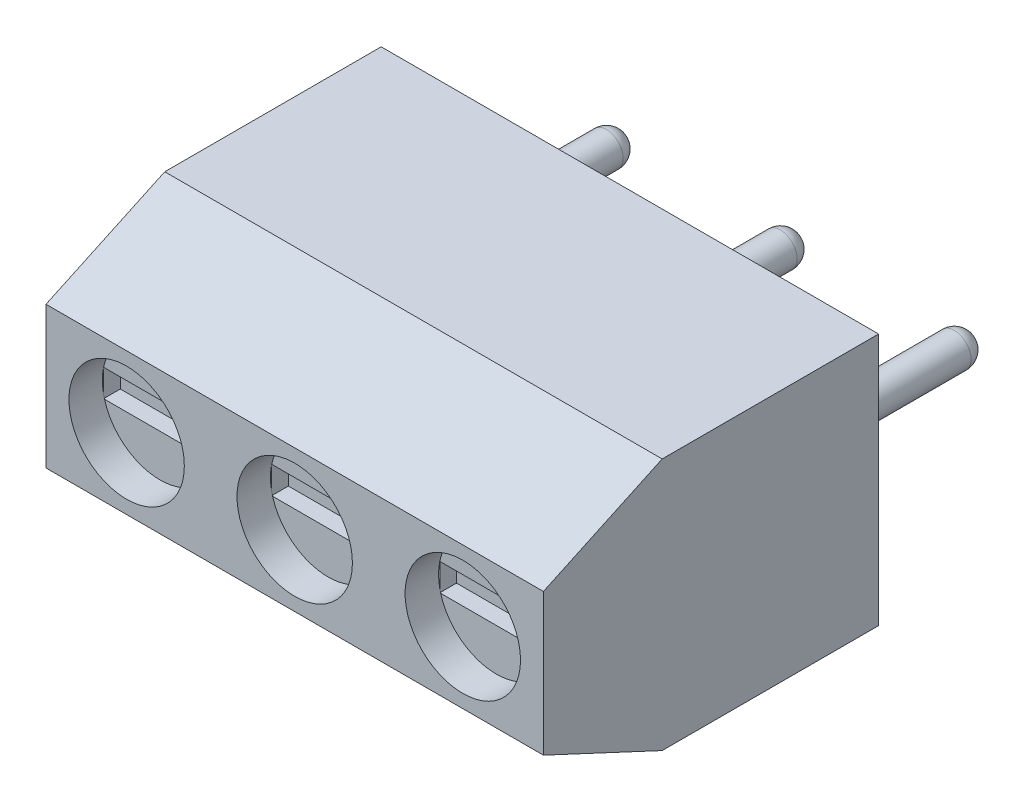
ISO-10303-21;
HEADER;
FILE_DESCRIPTION(('STEP AP214'),'2;1');
FILE_NAME('part.step','',(''),(''),'','','');
FILE_SCHEMA(('AUTOMOTIVE_DESIGN { 1 0 10303 214 1 1 1 1 }'));
ENDSEC;
DATA;
#1=APPLICATION_CONTEXT('core data for automotive mechanical design processes');
#2=APPLICATION_PROTOCOL_DEFINITION('international standard','automotive_design',2000,#1);
#3=PRODUCT_CONTEXT('',#1,'mechanical');
#4=PRODUCT('Part','Part','',(#3));
#5=PRODUCT_RELATED_PRODUCT_CATEGORY('part','',(#4));
#6=PRODUCT_DEFINITION_FORMATION('','',#4);
#7=PRODUCT_DEFINITION_CONTEXT('part definition',#1,'design');
#8=PRODUCT_DEFINITION('design','',#6,#7);
#9=PRODUCT_DEFINITION_SHAPE('','',#8);
#10=(LENGTH_UNIT() NAMED_UNIT(*) SI_UNIT(.MILLI.,.METRE.));
#11=(NAMED_UNIT(*) PLANE_ANGLE_UNIT() SI_UNIT($,.RADIAN.));
#12=(NAMED_UNIT(*) SI_UNIT($,.STERADIAN.) SOLID_ANGLE_UNIT());
#13=UNCERTAINTY_MEASURE_WITH_UNIT(LENGTH_MEASURE(1.E-05),#10,'distance_accuracy_value','');
#14=(GEOMETRIC_REPRESENTATION_CONTEXT(3) GLOBAL_UNCERTAINTY_ASSIGNED_CONTEXT((#13)) GLOBAL_UNIT_ASSIGNED_CONTEXT((#10,
#11,#12)) REPRESENTATION_CONTEXT('',''));
#15=CARTESIAN_POINT('',(0.,0.,0.));
#16=DIRECTION('',(0.,0.,1.));
#17=DIRECTION('',(1.,0.,0.));
#18=AXIS2_PLACEMENT_3D('',#15,#16,#17);
#19=CARTESIAN_POINT('',(12.34,3.2,3.23499999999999));
#20=DIRECTION('',(0.,-1.,0.));
#21=DIRECTION('',(0.,0.,-1.));
#22=AXIS2_PLACEMENT_3D('',#19,#20,#21);
#23=PLANE('',#22);
#24=DIRECTION('',(0.,0.,1.));
#25=VECTOR('',#24,1.);
#26=CARTESIAN_POINT('',(13.9446108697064,3.2,3.75756951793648));
#27=LINE('',#26,#25);
#28=CARTESIAN_POINT('',(13.9446108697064,3.2,2.75453256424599));
#29=VERTEX_POINT('',#28);
#30=CARTESIAN_POINT('',(13.9446108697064,3.2,3.71546743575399));
#31=VERTEX_POINT('',#30);
#32=EDGE_CURVE('E360',#29,#31,#27,.T.);
#33=ORIENTED_EDGE('',*,*,#32,.F.);
#34=CARTESIAN_POINT('',(12.34,3.2,3.23499999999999));
#35=DIRECTION('',(0.,-1.,0.));
#36=DIRECTION('',(0.,0.,-1.));
#37=AXIS2_PLACEMENT_3D('',#34,#35,#36);
#38=CIRCLE('',#37,1.675);
#39=EDGE_CURVE('E559',#29,#31,#38,.T.);
#40=ORIENTED_EDGE('',*,*,#39,.T.);
#41=EDGE_LOOP('',(#33,#40));
#42=FACE_BOUND('',#41,.T.);
#43=ADVANCED_FACE('F31',(#42),#23,.T.);
#44=DIRECTION('',(1.,0.,0.));
#45=VECTOR('',#44,1.);
#46=CARTESIAN_POINT('',(10.7486024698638,3.2,2.75453256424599));
#47=LINE('',#46,#45);
#48=CARTESIAN_POINT('',(10.7486024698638,3.2,2.75453256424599));
#49=VERTEX_POINT('',#48);
#50=EDGE_CURVE('E336',#49,#29,#47,.T.);
#51=ORIENTED_EDGE('',*,*,#50,.F.);
#52=DIRECTION('',(0.,0.,-1.));
#53=VECTOR('',#52,1.);
#54=CARTESIAN_POINT('',(10.7486024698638,3.2,3.75756951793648));
#55=LINE('',#54,#53);
#56=CARTESIAN_POINT('',(10.7486024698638,3.2,3.75756951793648));
#57=VERTEX_POINT('',#56);
#58=EDGE_CURVE('E348',#57,#49,#55,.T.);
#59=ORIENTED_EDGE('',*,*,#58,.F.);
#60=EDGE_CURVE('E356',#57,#29,#38,.T.);
#61=ORIENTED_EDGE('',*,*,#60,.T.);
#62=EDGE_LOOP('',(#51,#59,#61));
#63=FACE_BOUND('',#62,.T.);
#64=ADVANCED_FACE('F355',(#63),#23,.T.);
#65=CARTESIAN_POINT('',(7.44,3.2,3.23499999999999));
#66=DIRECTION('',(0.,-1.,0.));
#67=DIRECTION('',(0.,0.,-1.));
#68=AXIS2_PLACEMENT_3D('',#65,#66,#67);
#69=PLANE('',#68);
#70=DIRECTION('',(0.,0.,1.));
#71=VECTOR('',#70,1.);
#72=CARTESIAN_POINT('',(7.98918636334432,3.2,4.81740934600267));
#73=LINE('',#72,#71);
#74=CARTESIAN_POINT('',(7.98918636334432,3.2,1.65259065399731));
#75=VERTEX_POINT('',#74);
#76=CARTESIAN_POINT('',(7.98918636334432,3.2,4.81740934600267));
#77=VERTEX_POINT('',#76);
#78=EDGE_CURVE('E373',#75,#77,#73,.T.);
#79=ORIENTED_EDGE('',*,*,#78,.F.);
#80=CARTESIAN_POINT('',(7.44,3.2,3.23499999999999));
#81=DIRECTION('',(0.,-1.,0.));
#82=DIRECTION('',(0.,0.,-1.));
#83=AXIS2_PLACEMENT_3D('',#80,#81,#82);
#84=CIRCLE('',#83,1.675);
#85=EDGE_CURVE('E575',#75,#77,#84,.T.);
#86=ORIENTED_EDGE('',*,*,#85,.T.);
#87=EDGE_LOOP('',(#79,#86));
#88=FACE_BOUND('',#87,.T.);
#89=ADVANCED_FACE('F814',(#88),#69,.T.);
#90=DIRECTION('',(-1.,0.,0.));
#91=VECTOR('',#90,1.);
#92=CARTESIAN_POINT('',(7.98918636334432,3.2,4.81740934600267));
#93=LINE('',#92,#91);
#94=CARTESIAN_POINT('',(6.89081363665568,3.2,4.81740934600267));
#95=VERTEX_POINT('',#94);
#96=EDGE_CURVE('E379',#77,#95,#93,.T.);
#97=ORIENTED_EDGE('',*,*,#96,.F.);
#98=EDGE_CURVE('E579',#77,#95,#84,.T.);
#99=ORIENTED_EDGE('',*,*,#98,.T.);
#100=EDGE_LOOP('',(#97,#99));
#101=FACE_BOUND('',#100,.T.);
#102=ADVANCED_FACE('F884',(#101),#69,.T.);
#103=DIRECTION('',(0.,0.,-1.));
#104=VECTOR('',#103,1.);
#105=CARTESIAN_POINT('',(6.89081363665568,3.2,4.81740934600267));
#106=LINE('',#105,#104);
#107=CARTESIAN_POINT('',(6.89081363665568,3.2,1.65259065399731));
#108=VERTEX_POINT('',#107);
#109=EDGE_CURVE('E55',#95,#108,#106,.T.);
#110=ORIENTED_EDGE('',*,*,#109,.F.);
#111=EDGE_CURVE('E892',#95,#108,#84,.T.);
#112=ORIENTED_EDGE('',*,*,#111,.T.);
#113=EDGE_LOOP('',(#110,#112));
#114=FACE_BOUND('',#113,.T.);
#115=ADVANCED_FACE('F899',(#114),#69,.T.);
#116=CARTESIAN_POINT('',(2.535,3.2,3.23499999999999));
#117=DIRECTION('',(0.,-1.,0.));
#118=DIRECTION('',(0.,0.,-1.));
#119=AXIS2_PLACEMENT_3D('',#116,#117,#118);
#120=PLANE('',#119);
#121=DIRECTION('',(0.,0.,1.));
#122=VECTOR('',#121,1.);
#123=CARTESIAN_POINT('',(4.13961086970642,3.2,3.75756951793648));
#124=LINE('',#123,#122);
#125=CARTESIAN_POINT('',(4.13961086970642,3.2,2.75453256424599));
#126=VERTEX_POINT('',#125);
#127=CARTESIAN_POINT('',(4.13961086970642,3.2,3.71546743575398));
#128=VERTEX_POINT('',#127);
#129=EDGE_CURVE('E413',#126,#128,#124,.T.);
#130=ORIENTED_EDGE('',*,*,#129,.F.);
#131=CARTESIAN_POINT('',(2.535,3.2,3.23499999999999));
#132=DIRECTION('',(0.,-1.,0.));
#133=DIRECTION('',(0.,0.,-1.));
#134=AXIS2_PLACEMENT_3D('',#131,#132,#133);
#135=CIRCLE('',#134,1.675);
#136=EDGE_CURVE('E567',#126,#128,#135,.T.);
#137=ORIENTED_EDGE('',*,*,#136,.T.);
#138=EDGE_LOOP('',(#130,#137));
#139=FACE_BOUND('',#138,.T.);
#140=ADVANCED_FACE('F787',(#139),#120,.T.);
#141=DIRECTION('',(1.,0.,0.));
#142=VECTOR('',#141,1.);
#143=CARTESIAN_POINT('',(0.943602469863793,3.2,2.75453256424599));
#144=LINE('',#143,#142);
#145=CARTESIAN_POINT('',(0.943602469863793,3.2,2.75453256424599));
#146=VERTEX_POINT('',#145);
#147=EDGE_CURVE('E409',#146,#126,#144,.T.);
#148=ORIENTED_EDGE('',*,*,#147,.F.);
#149=DIRECTION('',(0.,0.,-1.));
#150=VECTOR('',#149,1.);
#151=CARTESIAN_POINT('',(0.943602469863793,3.2,3.75756951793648));
#152=LINE('',#151,#150);
#153=CARTESIAN_POINT('',(0.943602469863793,3.2,3.75756951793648));
#154=VERTEX_POINT('',#153);
#155=EDGE_CURVE('E401',#154,#146,#152,.T.);
#156=ORIENTED_EDGE('',*,*,#155,.F.);
#157=EDGE_CURVE('E566',#154,#126,#135,.T.);
#158=ORIENTED_EDGE('',*,*,#157,.T.);
#159=EDGE_LOOP('',(#148,#156,#158));
#160=FACE_BOUND('',#159,.T.);
#161=ADVANCED_FACE('F775',(#160),#120,.T.);
#162=CARTESIAN_POINT('',(12.4598795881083,3.775,9.02));
#163=DIRECTION('',(0.,0.,1.));
#164=DIRECTION('',(1.,0.,0.));
#165=AXIS2_PLACEMENT_3D('',#162,#163,#164);
#166=PLANE('',#165);
#167=DIRECTION('',(0.,-1.,0.));
#168=VECTOR('',#167,1.);
#169=CARTESIAN_POINT('',(10.7707137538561,4.12477676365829,9.02));
#170=LINE('',#169,#168);
#171=CARTESIAN_POINT('',(10.7707137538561,4.12477676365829,9.02));
#172=VERTEX_POINT('',#171);
#173=CARTESIAN_POINT('',(10.7707137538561,3.42522323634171,9.02));
#174=VERTEX_POINT('',#173);
#175=EDGE_CURVE('E441',#172,#174,#170,.T.);
#176=ORIENTED_EDGE('',*,*,#175,.F.);
#177=CARTESIAN_POINT('',(12.4598795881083,3.775,9.02));
#178=DIRECTION('',(0.,0.,1.));
#179=DIRECTION('',(1.,0.,0.));
#180=AXIS2_PLACEMENT_3D('',#177,#178,#179);
#181=CIRCLE('',#180,1.725);
#182=EDGE_CURVE('E687',#172,#174,#181,.T.);
#183=ORIENTED_EDGE('',*,*,#182,.T.);
#184=EDGE_LOOP('',(#176,#183));
#185=FACE_BOUND('',#184,.T.);
#186=ADVANCED_FACE('F921',(#185),#166,.T.);
#187=DIRECTION('',(1.,0.,0.));
#188=VECTOR('',#187,1.);
#189=CARTESIAN_POINT('',(10.7707137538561,3.31073928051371,9.02));
#190=LINE('',#189,#188);
#191=CARTESIAN_POINT('',(10.7985286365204,3.31073928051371,9.02));
#192=VERTEX_POINT('',#191);
#193=CARTESIAN_POINT('',(14.1212305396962,3.31073928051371,9.02));
#194=VERTEX_POINT('',#193);
#195=EDGE_CURVE('E448',#192,#194,#190,.T.);
#196=ORIENTED_EDGE('',*,*,#195,.F.);
#197=EDGE_CURVE('E1568',#192,#194,#181,.T.);
#198=ORIENTED_EDGE('',*,*,#197,.T.);
#199=EDGE_LOOP('',(#196,#198));
#200=FACE_BOUND('',#199,.T.);
#201=ADVANCED_FACE('F1020',(#200),#166,.T.);
#202=CARTESIAN_POINT('',(7.435,3.775,9.02));
#203=DIRECTION('',(0.,0.,1.));
#204=DIRECTION('',(1.,0.,0.));
#205=AXIS2_PLACEMENT_3D('',#202,#203,#204);
#206=PLANE('',#205);
#207=DIRECTION('',(0.,-1.,0.));
#208=VECTOR('',#207,1.);
#209=CARTESIAN_POINT('',(5.74583416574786,3.31073928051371,9.02));
#210=LINE('',#209,#208);
#211=CARTESIAN_POINT('',(5.74583416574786,4.12477676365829,9.02));
#212=VERTEX_POINT('',#211);
#213=CARTESIAN_POINT('',(5.74583416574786,3.42522323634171,9.02));
#214=VERTEX_POINT('',#213);
#215=EDGE_CURVE('E483',#212,#214,#210,.T.);
#216=ORIENTED_EDGE('',*,*,#215,.F.);
#217=CARTESIAN_POINT('',(7.435,3.775,9.02));
#218=DIRECTION('',(0.,0.,1.));
#219=DIRECTION('',(1.,0.,0.));
#220=AXIS2_PLACEMENT_3D('',#217,#218,#219);
#221=CIRCLE('',#220,1.725);
#222=EDGE_CURVE('E679',#212,#214,#221,.T.);
#223=ORIENTED_EDGE('',*,*,#222,.T.);
#224=EDGE_LOOP('',(#216,#223));
#225=FACE_BOUND('',#224,.T.);
#226=ADVANCED_FACE('F1011',(#225),#206,.T.);
#227=DIRECTION('',(-1.,0.,0.));
#228=VECTOR('',#227,1.);
#229=CARTESIAN_POINT('',(9.09635095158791,4.12477676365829,9.02));
#230=LINE('',#229,#228);
#231=CARTESIAN_POINT('',(9.09635095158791,4.12477676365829,9.02));
#232=VERTEX_POINT('',#231);
#233=EDGE_CURVE('E479',#232,#212,#230,.T.);
#234=ORIENTED_EDGE('',*,*,#233,.F.);
#235=DIRECTION('',(0.,1.,0.));
#236=VECTOR('',#235,1.);
#237=CARTESIAN_POINT('',(9.09635095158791,3.31073928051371,9.02));
#238=LINE('',#237,#236);
#239=CARTESIAN_POINT('',(9.09635095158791,3.31073928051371,9.02));
#240=VERTEX_POINT('',#239);
#241=EDGE_CURVE('E468',#240,#232,#238,.T.);
#242=ORIENTED_EDGE('',*,*,#241,.F.);
#243=EDGE_CURVE('E678',#240,#212,#221,.T.);
#244=ORIENTED_EDGE('',*,*,#243,.T.);
#245=EDGE_LOOP('',(#234,#242,#244));
#246=FACE_BOUND('',#245,.T.);
#247=ADVANCED_FACE('F1004',(#246),#206,.T.);
#248=CARTESIAN_POINT('',(2.41012041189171,3.775,9.02));
#249=DIRECTION('',(0.,0.,1.));
#250=DIRECTION('',(1.,0.,0.));
#251=AXIS2_PLACEMENT_3D('',#248,#249,#250);
#252=PLANE('',#251);
#253=DIRECTION('',(0.,-1.,0.));
#254=VECTOR('',#253,1.);
#255=CARTESIAN_POINT('',(0.720954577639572,4.12477676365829,9.02));
#256=LINE('',#255,#254);
#257=CARTESIAN_POINT('',(0.720954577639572,4.12477676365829,9.02));
#258=VERTEX_POINT('',#257);
#259=CARTESIAN_POINT('',(0.720954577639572,3.42522323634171,9.02));
#260=VERTEX_POINT('',#259);
#261=EDGE_CURVE('E512',#258,#260,#256,.T.);
#262=ORIENTED_EDGE('',*,*,#261,.F.);
#263=CARTESIAN_POINT('',(2.41012041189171,3.775,9.02));
#264=DIRECTION('',(0.,0.,1.));
#265=DIRECTION('',(1.,0.,0.));
#266=AXIS2_PLACEMENT_3D('',#263,#264,#265);
#267=CIRCLE('',#266,1.725);
#268=EDGE_CURVE('E695',#258,#260,#267,.T.);
#269=ORIENTED_EDGE('',*,*,#268,.T.);
#270=EDGE_LOOP('',(#262,#269));
#271=FACE_BOUND('',#270,.T.);
#272=ADVANCED_FACE('F994',(#271),#252,.T.);
#273=DIRECTION('',(1.,0.,0.));
#274=VECTOR('',#273,1.);
#275=CARTESIAN_POINT('',(0.720954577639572,3.31073928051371,9.02));
#276=LINE('',#275,#274);
#277=CARTESIAN_POINT('',(0.748769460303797,3.31073928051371,9.02));
#278=VERTEX_POINT('',#277);
#279=CARTESIAN_POINT('',(4.07147136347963,3.31073928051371,9.02));
#280=VERTEX_POINT('',#279);
#281=EDGE_CURVE('E519',#278,#280,#276,.T.);
#282=ORIENTED_EDGE('',*,*,#281,.F.);
#283=EDGE_CURVE('E1553',#278,#280,#267,.T.);
#284=ORIENTED_EDGE('',*,*,#283,.T.);
#285=EDGE_LOOP('',(#282,#284));
#286=FACE_BOUND('',#285,.T.);
#287=ADVANCED_FACE('F941',(#286),#252,.T.);
#288=CARTESIAN_POINT('',(0.,0.,0.));
#289=DIRECTION('',(0.,0.,-1.));
#290=DIRECTION('',(-1.,0.,0.));
#291=AXIS2_PLACEMENT_3D('',#288,#289,#290);
#292=PLANE('',#291);
#293=CARTESIAN_POINT('',(2.235,3.775,0.));
#294=DIRECTION('',(0.,0.,-1.));
#295=DIRECTION('',(-1.,0.,0.));
#296=AXIS2_PLACEMENT_3D('',#293,#294,#295);
#297=CIRCLE('',#296,0.500000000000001);
#298=CARTESIAN_POINT('',(1.735,3.775,0.));
#299=VERTEX_POINT('',#298);
#300=EDGE_CURVE('E550',#299,#299,#297,.T.);
#301=ORIENTED_EDGE('',*,*,#300,.F.);
#302=EDGE_LOOP('',(#301));
#303=FACE_BOUND('',#302,.T.);
#304=DIRECTION('',(0.,-1.,0.));
#305=VECTOR('',#304,1.);
#306=CARTESIAN_POINT('',(0.,0.,0.));
#307=LINE('',#306,#305);
#308=CARTESIAN_POINT('',(0.,7.55,0.));
#309=VERTEX_POINT('',#308);
#310=CARTESIAN_POINT('',(0.,0.,0.));
#311=VERTEX_POINT('',#310);
#312=EDGE_CURVE('E698',#309,#311,#307,.T.);
#313=ORIENTED_EDGE('',*,*,#312,.F.);
#314=DIRECTION('',(-1.,0.,0.));
#315=VECTOR('',#314,1.);
#316=CARTESIAN_POINT('',(0.,7.55,0.));
#317=LINE('',#316,#315);
#318=CARTESIAN_POINT('',(14.87,7.55,0.));
#319=VERTEX_POINT('',#318);
#320=EDGE_CURVE('E708',#319,#309,#317,.T.);
#321=ORIENTED_EDGE('',*,*,#320,.F.);
#322=DIRECTION('',(0.,1.,0.));
#323=VECTOR('',#322,1.);
#324=CARTESIAN_POINT('',(14.87,0.,0.));
#325=LINE('',#324,#323);
#326=CARTESIAN_POINT('',(14.87,0.,0.));
#327=VERTEX_POINT('',#326);
#328=EDGE_CURVE('E705',#327,#319,#325,.T.);
#329=ORIENTED_EDGE('',*,*,#328,.F.);
#330=DIRECTION('',(1.,0.,0.));
#331=VECTOR('',#330,1.);
#332=CARTESIAN_POINT('',(0.,0.,0.));
#333=LINE('',#332,#331);
#334=EDGE_CURVE('E702',#311,#327,#333,.T.);
#335=ORIENTED_EDGE('',*,*,#334,.F.);
#336=EDGE_LOOP('',(#313,#321,#329,#335));
#337=FACE_BOUND('',#336,.T.);
#338=CARTESIAN_POINT('',(7.435,3.775,0.));
#339=DIRECTION('',(0.,0.,-1.));
#340=DIRECTION('',(-1.,0.,0.));
#341=AXIS2_PLACEMENT_3D('',#338,#339,#340);
#342=CIRCLE('',#341,0.500000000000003);
#343=CARTESIAN_POINT('',(6.935,3.775,0.));
#344=VERTEX_POINT('',#343);
#345=EDGE_CURVE('E553',#344,#344,#342,.T.);
#346=ORIENTED_EDGE('',*,*,#345,.F.);
#347=EDGE_LOOP('',(#346));
#348=FACE_BOUND('',#347,.T.);
#349=CARTESIAN_POINT('',(12.635,3.775,0.));
#350=DIRECTION('',(0.,0.,-1.));
#351=DIRECTION('',(-1.,0.,0.));
#352=AXIS2_PLACEMENT_3D('',#349,#350,#351);
#353=CIRCLE('',#352,0.500000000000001);
#354=CARTESIAN_POINT('',(12.135,3.775,0.));
#355=VERTEX_POINT('',#354);
#356=EDGE_CURVE('E539',#355,#355,#353,.T.);
#357=ORIENTED_EDGE('',*,*,#356,.F.);
#358=EDGE_LOOP('',(#357));
#359=FACE_BOUND('',#358,.T.);
#360=ADVANCED_FACE('F936',(#303,#337,#348,#359),#292,.T.);
#361=CARTESIAN_POINT('',(0.,0.,10.02));
#362=DIRECTION('',(1.,0.,0.));
#363=DIRECTION('',(0.,0.,-1.));
#364=AXIS2_PLACEMENT_3D('',#361,#362,#363);
#365=PLANE('',#364);
#366=DIRECTION('',(0.,-1.,0.));
#367=VECTOR('',#366,1.);
#368=CARTESIAN_POINT('',(0.,0.,10.02));
#369=LINE('',#368,#367);
#370=CARTESIAN_POINT('',(0.,5.89460781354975,10.02));
#371=VERTEX_POINT('',#370);
#372=CARTESIAN_POINT('',(0.,1.65539218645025,10.02));
#373=VERTEX_POINT('',#372);
#374=EDGE_CURVE('E711',#371,#373,#369,.T.);
#375=ORIENTED_EDGE('',*,*,#374,.F.);
#376=DIRECTION('',(0.,-0.422618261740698,0.906307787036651));
#377=VECTOR('',#376,1.);
#378=CARTESIAN_POINT('',(0.,5.89460781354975,10.02));
#379=LINE('',#378,#377);
#380=CARTESIAN_POINT('',(0.,7.55,6.46999999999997));
#381=VERTEX_POINT('',#380);
#382=EDGE_CURVE('E733',#371,#381,#379,.F.);
#383=ORIENTED_EDGE('',*,*,#382,.T.);
#384=DIRECTION('',(0.,0.,-1.));
#385=VECTOR('',#384,1.);
#386=CARTESIAN_POINT('',(0.,7.55,10.02));
#387=LINE('',#386,#385);
#388=EDGE_CURVE('E717',#381,#309,#387,.T.);
#389=ORIENTED_EDGE('',*,*,#388,.T.);
#390=ORIENTED_EDGE('',*,*,#312,.T.);
#391=DIRECTION('',(0.,0.,-1.));
#392=VECTOR('',#391,1.);
#393=CARTESIAN_POINT('',(0.,0.,10.02));
#394=LINE('',#393,#392);
#395=CARTESIAN_POINT('',(0.,0.,6.46999999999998));
#396=VERTEX_POINT('',#395);
#397=EDGE_CURVE('E723',#396,#311,#394,.T.);
#398=ORIENTED_EDGE('',*,*,#397,.F.);
#399=DIRECTION('',(0.,-0.422618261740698,-0.906307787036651));
#400=VECTOR('',#399,1.);
#401=CARTESIAN_POINT('',(0.,1.65539218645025,10.02));
#402=LINE('',#401,#400);
#403=EDGE_CURVE('E731',#396,#373,#402,.F.);
#404=ORIENTED_EDGE('',*,*,#403,.T.);
#405=EDGE_LOOP('',(#375,#383,#389,#390,#398,#404));
#406=FACE_BOUND('',#405,.T.);
#407=ADVANCED_FACE('F33',(#406),#365,.F.);
#408=CARTESIAN_POINT('',(0.,0.,10.02));
#409=DIRECTION('',(0.,1.,0.));
#410=DIRECTION('',(0.,0.,1.));
#411=AXIS2_PLACEMENT_3D('',#408,#409,#410);
#412=PLANE('',#411);
#413=DIRECTION('',(-1.,0.,0.));
#414=VECTOR('',#413,1.);
#415=CARTESIAN_POINT('',(4.54,0.,5.8));
#416=LINE('',#415,#414);
#417=CARTESIAN_POINT('',(4.54,0.,5.8));
#418=VERTEX_POINT('',#417);
#419=CARTESIAN_POINT('',(0.539999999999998,0.,5.8));
#420=VERTEX_POINT('',#419);
#421=EDGE_CURVE('E581',#418,#420,#416,.T.);
#422=ORIENTED_EDGE('',*,*,#421,.F.);
#423=DIRECTION('',(0.,0.,1.));
#424=VECTOR('',#423,1.);
#425=CARTESIAN_POINT('',(4.54,0.,5.8));
#426=LINE('',#425,#424);
#427=CARTESIAN_POINT('',(4.54,0.,0.800000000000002));
#428=VERTEX_POINT('',#427);
#429=EDGE_CURVE('E578',#428,#418,#426,.T.);
#430=ORIENTED_EDGE('',*,*,#429,.F.);
#431=DIRECTION('',(1.,0.,0.));
#432=VECTOR('',#431,1.);
#433=CARTESIAN_POINT('',(4.54,0.,0.800000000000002));
#434=LINE('',#433,#432);
#435=CARTESIAN_POINT('',(0.54,0.,0.800000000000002));
#436=VERTEX_POINT('',#435);
#437=EDGE_CURVE('E587',#436,#428,#434,.T.);
#438=ORIENTED_EDGE('',*,*,#437,.F.);
#439=DIRECTION('',(0.,0.,-1.));
#440=VECTOR('',#439,1.);
#441=CARTESIAN_POINT('',(0.539999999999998,0.,5.8));
#442=LINE('',#441,#440);
#443=EDGE_CURVE('E584',#420,#436,#442,.T.);
#444=ORIENTED_EDGE('',*,*,#443,.F.);
#445=EDGE_LOOP('',(#422,#430,#438,#444));
#446=FACE_BOUND('',#445,.T.);
#447=DIRECTION('',(-1.,0.,0.));
#448=VECTOR('',#447,1.);
#449=CARTESIAN_POINT('',(9.44,0.,5.8));
#450=LINE('',#449,#448);
#451=CARTESIAN_POINT('',(9.44,0.,5.8));
#452=VERTEX_POINT('',#451);
#453=CARTESIAN_POINT('',(5.44,0.,5.8));
#454=VERTEX_POINT('',#453);
#455=EDGE_CURVE('E613',#452,#454,#450,.T.);
#456=ORIENTED_EDGE('',*,*,#455,.F.);
#457=DIRECTION('',(0.,0.,1.));
#458=VECTOR('',#457,1.);
#459=CARTESIAN_POINT('',(9.44,0.,5.8));
#460=LINE('',#459,#458);
#461=CARTESIAN_POINT('',(9.44,0.,0.800000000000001));
#462=VERTEX_POINT('',#461);
#463=EDGE_CURVE('E605',#462,#452,#460,.T.);
#464=ORIENTED_EDGE('',*,*,#463,.F.);
#465=DIRECTION('',(1.,0.,0.));
#466=VECTOR('',#465,1.);
#467=CARTESIAN_POINT('',(9.44,0.,0.800000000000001));
#468=LINE('',#467,#466);
#469=CARTESIAN_POINT('',(5.44,0.,0.800000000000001));
#470=VERTEX_POINT('',#469);
#471=EDGE_CURVE('E619',#470,#462,#468,.T.);
#472=ORIENTED_EDGE('',*,*,#471,.F.);
#473=DIRECTION('',(0.,0.,-1.));
#474=VECTOR('',#473,1.);
#475=CARTESIAN_POINT('',(5.44,0.,5.8));
#476=LINE('',#475,#474);
#477=EDGE_CURVE('E616',#454,#470,#476,.T.);
#478=ORIENTED_EDGE('',*,*,#477,.F.);
#479=EDGE_LOOP('',(#456,#464,#472,#478));
#480=FACE_BOUND('',#479,.T.);
#481=DIRECTION('',(1.,0.,0.));
#482=VECTOR('',#481,1.);
#483=CARTESIAN_POINT('',(10.34,0.,0.800000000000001));
#484=LINE('',#483,#482);
#485=CARTESIAN_POINT('',(10.34,0.,0.8));
#486=VERTEX_POINT('',#485);
#487=CARTESIAN_POINT('',(14.34,0.,0.800000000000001));
#488=VERTEX_POINT('',#487);
#489=EDGE_CURVE('E645',#486,#488,#484,.T.);
#490=ORIENTED_EDGE('',*,*,#489,.F.);
#491=DIRECTION('',(0.,0.,-1.));
#492=VECTOR('',#491,1.);
#493=CARTESIAN_POINT('',(10.34,0.,0.800000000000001));
#494=LINE('',#493,#492);
#495=CARTESIAN_POINT('',(10.34,0.,5.8));
#496=VERTEX_POINT('',#495);
#497=EDGE_CURVE('E637',#496,#486,#494,.T.);
#498=ORIENTED_EDGE('',*,*,#497,.F.);
#499=DIRECTION('',(-1.,0.,0.));
#500=VECTOR('',#499,1.);
#501=CARTESIAN_POINT('',(10.34,0.,5.8));
#502=LINE('',#501,#500);
#503=CARTESIAN_POINT('',(14.34,0.,5.8));
#504=VERTEX_POINT('',#503);
#505=EDGE_CURVE('E651',#504,#496,#502,.T.);
#506=ORIENTED_EDGE('',*,*,#505,.F.);
#507=DIRECTION('',(0.,0.,1.));
#508=VECTOR('',#507,1.);
#509=CARTESIAN_POINT('',(14.34,0.,0.800000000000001));
#510=LINE('',#509,#508);
#511=EDGE_CURVE('E648',#488,#504,#510,.T.);
#512=ORIENTED_EDGE('',*,*,#511,.F.);
#513=EDGE_LOOP('',(#490,#498,#506,#512));
#514=FACE_BOUND('',#513,.T.);
#515=DIRECTION('',(0.,0.,-1.));
#516=VECTOR('',#515,1.);
#517=CARTESIAN_POINT('',(14.87,0.,10.02));
#518=LINE('',#517,#516);
#519=CARTESIAN_POINT('',(14.87,0.,6.46999999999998));
#520=VERTEX_POINT('',#519);
#521=EDGE_CURVE('E721',#520,#327,#518,.T.);
#522=ORIENTED_EDGE('',*,*,#521,.F.);
#523=DIRECTION('',(-1.,0.,0.));
#524=VECTOR('',#523,1.);
#525=CARTESIAN_POINT('',(0.,0.,6.46999999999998));
#526=LINE('',#525,#524);
#527=EDGE_CURVE('E741',#520,#396,#526,.T.);
#528=ORIENTED_EDGE('',*,*,#527,.T.);
#529=ORIENTED_EDGE('',*,*,#397,.T.);
#530=ORIENTED_EDGE('',*,*,#334,.T.);
#531=EDGE_LOOP('',(#522,#528,#529,#530));
#532=FACE_BOUND('',#531,.T.);
#533=ADVANCED_FACE('F1468',(#446,#480,#514,#532),#412,.F.);
#534=CARTESIAN_POINT('',(14.87,0.,10.02));
#535=DIRECTION('',(-1.,0.,0.));
#536=DIRECTION('',(0.,0.,1.));
#537=AXIS2_PLACEMENT_3D('',#534,#535,#536);
#538=PLANE('',#537);
#539=DIRECTION('',(0.,0.,-1.));
#540=VECTOR('',#539,1.);
#541=CARTESIAN_POINT('',(14.87,7.55,10.02));
#542=LINE('',#541,#540);
#543=CARTESIAN_POINT('',(14.87,7.55,6.46999999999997));
#544=VERTEX_POINT('',#543);
#545=EDGE_CURVE('E719',#544,#319,#542,.T.);
#546=ORIENTED_EDGE('',*,*,#545,.F.);
#547=DIRECTION('',(0.,0.422618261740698,-0.906307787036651));
#548=VECTOR('',#547,1.);
#549=CARTESIAN_POINT('',(14.87,5.89460781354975,10.02));
#550=LINE('',#549,#548);
#551=CARTESIAN_POINT('',(14.87,5.89460781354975,10.02));
#552=VERTEX_POINT('',#551);
#553=EDGE_CURVE('E739',#544,#552,#550,.F.);
#554=ORIENTED_EDGE('',*,*,#553,.T.);
#555=DIRECTION('',(0.,1.,0.));
#556=VECTOR('',#555,1.);
#557=CARTESIAN_POINT('',(14.87,0.,10.02));
#558=LINE('',#557,#556);
#559=CARTESIAN_POINT('',(14.87,1.65539218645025,10.02));
#560=VERTEX_POINT('',#559);
#561=EDGE_CURVE('E714',#560,#552,#558,.T.);
#562=ORIENTED_EDGE('',*,*,#561,.F.);
#563=DIRECTION('',(0.,0.422618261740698,0.906307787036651));
#564=VECTOR('',#563,1.);
#565=CARTESIAN_POINT('',(14.87,1.65539218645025,10.02));
#566=LINE('',#565,#564);
#567=EDGE_CURVE('E737',#560,#520,#566,.F.);
#568=ORIENTED_EDGE('',*,*,#567,.T.);
#569=ORIENTED_EDGE('',*,*,#521,.T.);
#570=ORIENTED_EDGE('',*,*,#328,.T.);
#571=EDGE_LOOP('',(#546,#554,#562,#568,#569,#570));
#572=FACE_BOUND('',#571,.T.);
#573=ADVANCED_FACE('F1460',(#572),#538,.F.);
#574=CARTESIAN_POINT('',(0.,7.55,10.02));
#575=DIRECTION('',(0.,-1.,0.));
#576=DIRECTION('',(1.,0.,0.));
#577=AXIS2_PLACEMENT_3D('',#574,#575,#576);
#578=PLANE('',#577);
#579=ORIENTED_EDGE('',*,*,#388,.F.);
#580=DIRECTION('',(1.,0.,0.));
#581=VECTOR('',#580,1.);
#582=CARTESIAN_POINT('',(0.,7.55,6.46999999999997));
#583=LINE('',#582,#581);
#584=EDGE_CURVE('E735',#381,#544,#583,.T.);
#585=ORIENTED_EDGE('',*,*,#584,.T.);
#586=ORIENTED_EDGE('',*,*,#545,.T.);
#587=ORIENTED_EDGE('',*,*,#320,.T.);
#588=EDGE_LOOP('',(#579,#585,#586,#587));
#589=FACE_BOUND('',#588,.T.);
#590=ADVANCED_FACE('F1453',(#589),#578,.F.);
#591=CARTESIAN_POINT('',(0.,0.,10.02));
#592=DIRECTION('',(0.,0.,-1.));
#593=DIRECTION('',(-1.,0.,0.));
#594=AXIS2_PLACEMENT_3D('',#591,#592,#593);
#595=PLANE('',#594);
#596=CARTESIAN_POINT('',(7.435,3.775,10.02));
#597=DIRECTION('',(0.,0.,1.));
#598=DIRECTION('',(1.,0.,0.));
#599=AXIS2_PLACEMENT_3D('',#596,#597,#598);
#600=CIRCLE('',#599,1.725);
#601=CARTESIAN_POINT('',(9.16,3.775,10.02));
#602=VERTEX_POINT('',#601);
#603=EDGE_CURVE('E669',#602,#602,#600,.T.);
#604=ORIENTED_EDGE('',*,*,#603,.F.);
#605=EDGE_LOOP('',(#604));
#606=FACE_BOUND('',#605,.T.);
#607=CARTESIAN_POINT('',(12.4598795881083,3.775,10.02));
#608=DIRECTION('',(0.,0.,1.));
#609=DIRECTION('',(1.,0.,0.));
#610=AXIS2_PLACEMENT_3D('',#607,#608,#609);
#611=CIRCLE('',#610,1.725);
#612=CARTESIAN_POINT('',(14.1848795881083,3.775,10.02));
#613=VERTEX_POINT('',#612);
#614=EDGE_CURVE('E682',#613,#613,#611,.T.);
#615=ORIENTED_EDGE('',*,*,#614,.F.);
#616=EDGE_LOOP('',(#615));
#617=FACE_BOUND('',#616,.T.);
#618=CARTESIAN_POINT('',(2.41012041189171,3.775,10.02));
#619=DIRECTION('',(0.,0.,1.));
#620=DIRECTION('',(1.,0.,0.));
#621=AXIS2_PLACEMENT_3D('',#618,#619,#620);
#622=CIRCLE('',#621,1.725);
#623=CARTESIAN_POINT('',(4.13512041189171,3.775,10.02));
#624=VERTEX_POINT('',#623);
#625=EDGE_CURVE('E690',#624,#624,#622,.T.);
#626=ORIENTED_EDGE('',*,*,#625,.F.);
#627=EDGE_LOOP('',(#626));
#628=FACE_BOUND('',#627,.T.);
#629=ORIENTED_EDGE('',*,*,#561,.T.);
#630=DIRECTION('',(-1.,0.,0.));
#631=VECTOR('',#630,1.);
#632=CARTESIAN_POINT('',(0.,5.89460781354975,10.02));
#633=LINE('',#632,#631);
#634=EDGE_CURVE('E728',#552,#371,#633,.T.);
#635=ORIENTED_EDGE('',*,*,#634,.T.);
#636=ORIENTED_EDGE('',*,*,#374,.T.);
#637=DIRECTION('',(1.,0.,0.));
#638=VECTOR('',#637,1.);
#639=CARTESIAN_POINT('',(0.,1.65539218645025,10.02));
#640=LINE('',#639,#638);
#641=EDGE_CURVE('E725',#373,#560,#640,.T.);
#642=ORIENTED_EDGE('',*,*,#641,.T.);
#643=EDGE_LOOP('',(#629,#635,#636,#642));
#644=FACE_BOUND('',#643,.T.);
#645=ADVANCED_FACE('F1445',(#606,#617,#628,#644),#595,.F.);
#646=CARTESIAN_POINT('',(0.,5.89460781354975,10.02));
#647=DIRECTION('',(0.,-0.906307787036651,-0.422618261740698));
#648=DIRECTION('',(0.,0.422618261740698,-0.906307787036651));
#649=AXIS2_PLACEMENT_3D('',#646,#647,#648);
#650=PLANE('',#649);
#651=ORIENTED_EDGE('',*,*,#553,.F.);
#652=ORIENTED_EDGE('',*,*,#584,.F.);
#653=ORIENTED_EDGE('',*,*,#382,.F.);
#654=ORIENTED_EDGE('',*,*,#634,.F.);
#655=EDGE_LOOP('',(#651,#652,#653,#654));
#656=FACE_BOUND('',#655,.T.);
#657=ADVANCED_FACE('F1436',(#656),#650,.F.);
#658=CARTESIAN_POINT('',(0.,1.65539218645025,10.02));
#659=DIRECTION('',(0.,0.906307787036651,-0.422618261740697));
#660=DIRECTION('',(0.,0.422618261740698,0.906307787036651));
#661=AXIS2_PLACEMENT_3D('',#658,#659,#660);
#662=PLANE('',#661);
#663=ORIENTED_EDGE('',*,*,#403,.F.);
#664=ORIENTED_EDGE('',*,*,#527,.F.);
#665=ORIENTED_EDGE('',*,*,#567,.F.);
#666=ORIENTED_EDGE('',*,*,#641,.F.);
#667=EDGE_LOOP('',(#663,#664,#665,#666));
#668=FACE_BOUND('',#667,.T.);
#669=ADVANCED_FACE('F1428',(#668),#662,.F.);
#670=CARTESIAN_POINT('',(2.41012041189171,3.775,9.02));
#671=DIRECTION('',(0.,0.,1.));
#672=DIRECTION('',(1.,0.,0.));
#673=AXIS2_PLACEMENT_3D('',#670,#671,#672);
#674=CYLINDRICAL_SURFACE('',#673,1.725);
#675=ORIENTED_EDGE('',*,*,#268,.F.);
#676=EDGE_CURVE('E694',#280,#258,#267,.T.);
#677=ORIENTED_EDGE('',*,*,#676,.F.);
#678=ORIENTED_EDGE('',*,*,#283,.F.);
#679=EDGE_CURVE('E699',#260,#278,#267,.T.);
#680=ORIENTED_EDGE('',*,*,#679,.F.);
#681=EDGE_LOOP('',(#675,#677,#678,#680));
#682=FACE_BOUND('',#681,.T.);
#683=ORIENTED_EDGE('',*,*,#625,.T.);
#684=EDGE_LOOP('',(#683));
#685=FACE_BOUND('',#684,.T.);
#686=ADVANCED_FACE('F1422',(#682,#685),#674,.F.);
#687=DIRECTION('',(0.,1.,0.));
#688=VECTOR('',#687,1.);
#689=CARTESIAN_POINT('',(4.07147136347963,4.12477676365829,9.02));
#690=LINE('',#689,#688);
#691=CARTESIAN_POINT('',(4.07147136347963,4.12477676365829,9.02));
#692=VERTEX_POINT('',#691);
#693=EDGE_CURVE('E518',#280,#692,#690,.T.);
#694=ORIENTED_EDGE('',*,*,#693,.F.);
#695=ORIENTED_EDGE('',*,*,#676,.T.);
#696=DIRECTION('',(-1.,0.,0.));
#697=VECTOR('',#696,1.);
#698=CARTESIAN_POINT('',(0.720954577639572,4.12477676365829,9.02));
#699=LINE('',#698,#697);
#700=EDGE_CURVE('E521',#692,#258,#699,.T.);
#701=ORIENTED_EDGE('',*,*,#700,.F.);
#702=EDGE_LOOP('',(#694,#695,#701));
#703=FACE_BOUND('',#702,.T.);
#704=ADVANCED_FACE('F997',(#703),#252,.T.);
#705=CARTESIAN_POINT('',(12.4598795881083,3.775,9.02));
#706=DIRECTION('',(0.,0.,1.));
#707=DIRECTION('',(1.,0.,0.));
#708=AXIS2_PLACEMENT_3D('',#705,#706,#707);
#709=CYLINDRICAL_SURFACE('',#708,1.725);
#710=ORIENTED_EDGE('',*,*,#182,.F.);
#711=EDGE_CURVE('E686',#194,#172,#181,.T.);
#712=ORIENTED_EDGE('',*,*,#711,.F.);
#713=ORIENTED_EDGE('',*,*,#197,.F.);
#714=EDGE_CURVE('E691',#174,#192,#181,.T.);
#715=ORIENTED_EDGE('',*,*,#714,.F.);
#716=EDGE_LOOP('',(#710,#712,#713,#715));
#717=FACE_BOUND('',#716,.T.);
#718=ORIENTED_EDGE('',*,*,#614,.T.);
#719=EDGE_LOOP('',(#718));
#720=FACE_BOUND('',#719,.T.);
#721=ADVANCED_FACE('F1408',(#717,#720),#709,.F.);
#722=DIRECTION('',(0.,1.,0.));
#723=VECTOR('',#722,1.);
#724=CARTESIAN_POINT('',(14.1212305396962,4.12477676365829,9.02));
#725=LINE('',#724,#723);
#726=CARTESIAN_POINT('',(14.1212305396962,4.12477676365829,9.02));
#727=VERTEX_POINT('',#726);
#728=EDGE_CURVE('E447',#194,#727,#725,.T.);
#729=ORIENTED_EDGE('',*,*,#728,.F.);
#730=ORIENTED_EDGE('',*,*,#711,.T.);
#731=DIRECTION('',(-1.,0.,0.));
#732=VECTOR('',#731,1.);
#733=CARTESIAN_POINT('',(10.7707137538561,4.12477676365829,9.02));
#734=LINE('',#733,#732);
#735=EDGE_CURVE('E450',#727,#172,#734,.T.);
#736=ORIENTED_EDGE('',*,*,#735,.F.);
#737=EDGE_LOOP('',(#729,#730,#736));
#738=FACE_BOUND('',#737,.T.);
#739=ADVANCED_FACE('F1029',(#738),#166,.T.);
#740=CARTESIAN_POINT('',(7.435,3.775,9.02));
#741=DIRECTION('',(0.,0.,1.));
#742=DIRECTION('',(1.,0.,0.));
#743=AXIS2_PLACEMENT_3D('',#740,#741,#742);
#744=CYLINDRICAL_SURFACE('',#743,1.725);
#745=ORIENTED_EDGE('',*,*,#222,.F.);
#746=ORIENTED_EDGE('',*,*,#243,.F.);
#747=CARTESIAN_POINT('',(5.77364904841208,3.31073928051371,9.02));
#748=VERTEX_POINT('',#747);
#749=EDGE_CURVE('E1584',#748,#240,#221,.T.);
#750=ORIENTED_EDGE('',*,*,#749,.F.);
#751=EDGE_CURVE('E683',#214,#748,#221,.T.);
#752=ORIENTED_EDGE('',*,*,#751,.F.);
#753=EDGE_LOOP('',(#745,#746,#750,#752));
#754=FACE_BOUND('',#753,.T.);
#755=ORIENTED_EDGE('',*,*,#603,.T.);
#756=EDGE_LOOP('',(#755));
#757=FACE_BOUND('',#756,.T.);
#758=ADVANCED_FACE('F1394',(#754,#757),#744,.F.);
#759=DIRECTION('',(1.,0.,0.));
#760=VECTOR('',#759,1.);
#761=CARTESIAN_POINT('',(9.09635095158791,3.31073928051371,9.02));
#762=LINE('',#761,#760);
#763=EDGE_CURVE('E489',#748,#240,#762,.T.);
#764=ORIENTED_EDGE('',*,*,#763,.F.);
#765=ORIENTED_EDGE('',*,*,#749,.T.);
#766=EDGE_LOOP('',(#764,#765));
#767=FACE_BOUND('',#766,.T.);
#768=ADVANCED_FACE('F1014',(#767),#206,.T.);
#769=CARTESIAN_POINT('',(10.34,1.6,0.800000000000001));
#770=DIRECTION('',(-1.,0.,0.));
#771=DIRECTION('',(0.,0.,1.));
#772=AXIS2_PLACEMENT_3D('',#769,#770,#771);
#773=PLANE('',#772);
#774=ORIENTED_EDGE('',*,*,#497,.T.);
#775=DIRECTION('',(0.,-1.,0.));
#776=VECTOR('',#775,1.);
#777=CARTESIAN_POINT('',(10.34,1.6,0.800000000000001));
#778=LINE('',#777,#776);
#779=CARTESIAN_POINT('',(10.34,1.6,0.800000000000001));
#780=VERTEX_POINT('',#779);
#781=EDGE_CURVE('E666',#780,#486,#778,.T.);
#782=ORIENTED_EDGE('',*,*,#781,.F.);
#783=DIRECTION('',(0.,0.,-1.));
#784=VECTOR('',#783,1.);
#785=CARTESIAN_POINT('',(10.34,1.6,0.800000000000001));
#786=LINE('',#785,#784);
#787=CARTESIAN_POINT('',(10.34,1.6,5.8));
#788=VERTEX_POINT('',#787);
#789=EDGE_CURVE('E654',#788,#780,#786,.T.);
#790=ORIENTED_EDGE('',*,*,#789,.F.);
#791=DIRECTION('',(0.,-1.,0.));
#792=VECTOR('',#791,1.);
#793=CARTESIAN_POINT('',(10.34,1.6,5.8));
#794=LINE('',#793,#792);
#795=EDGE_CURVE('E667',#788,#496,#794,.T.);
#796=ORIENTED_EDGE('',*,*,#795,.T.);
#797=EDGE_LOOP('',(#774,#782,#790,#796));
#798=FACE_BOUND('',#797,.T.);
#799=ADVANCED_FACE('F1379',(#798),#773,.F.);
#800=CARTESIAN_POINT('',(10.34,1.6,5.8));
#801=DIRECTION('',(0.,0.,1.));
#802=DIRECTION('',(1.,0.,0.));
#803=AXIS2_PLACEMENT_3D('',#800,#801,#802);
#804=PLANE('',#803);
#805=ORIENTED_EDGE('',*,*,#505,.T.);
#806=ORIENTED_EDGE('',*,*,#795,.F.);
#807=DIRECTION('',(-1.,0.,0.));
#808=VECTOR('',#807,1.);
#809=CARTESIAN_POINT('',(10.34,1.6,5.8));
#810=LINE('',#809,#808);
#811=CARTESIAN_POINT('',(14.34,1.6,5.8));
#812=VERTEX_POINT('',#811);
#813=EDGE_CURVE('E663',#812,#788,#810,.T.);
#814=ORIENTED_EDGE('',*,*,#813,.F.);
#815=DIRECTION('',(0.,-1.,0.));
#816=VECTOR('',#815,1.);
#817=CARTESIAN_POINT('',(14.34,1.6,5.8));
#818=LINE('',#817,#816);
#819=EDGE_CURVE('E670',#812,#504,#818,.T.);
#820=ORIENTED_EDGE('',*,*,#819,.T.);
#821=EDGE_LOOP('',(#805,#806,#814,#820));
#822=FACE_BOUND('',#821,.T.);
#823=ADVANCED_FACE('F1371',(#822),#804,.F.);
#824=CARTESIAN_POINT('',(14.34,1.6,0.800000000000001));
#825=DIRECTION('',(1.,0.,0.));
#826=DIRECTION('',(0.,0.,-1.));
#827=AXIS2_PLACEMENT_3D('',#824,#825,#826);
#828=PLANE('',#827);
#829=ORIENTED_EDGE('',*,*,#511,.T.);
#830=ORIENTED_EDGE('',*,*,#819,.F.);
#831=DIRECTION('',(0.,0.,1.));
#832=VECTOR('',#831,1.);
#833=CARTESIAN_POINT('',(14.34,1.6,0.800000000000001));
#834=LINE('',#833,#832);
#835=CARTESIAN_POINT('',(14.34,1.6,0.800000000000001));
#836=VERTEX_POINT('',#835);
#837=EDGE_CURVE('E660',#836,#812,#834,.T.);
#838=ORIENTED_EDGE('',*,*,#837,.F.);
#839=DIRECTION('',(0.,-1.,0.));
#840=VECTOR('',#839,1.);
#841=CARTESIAN_POINT('',(14.34,1.6,0.800000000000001));
#842=LINE('',#841,#840);
#843=EDGE_CURVE('E672',#836,#488,#842,.T.);
#844=ORIENTED_EDGE('',*,*,#843,.T.);
#845=EDGE_LOOP('',(#829,#830,#838,#844));
#846=FACE_BOUND('',#845,.T.);
#847=ADVANCED_FACE('F1363',(#846),#828,.F.);
#848=CARTESIAN_POINT('',(10.34,1.6,0.800000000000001));
#849=DIRECTION('',(0.,0.,-1.));
#850=DIRECTION('',(-1.,0.,0.));
#851=AXIS2_PLACEMENT_3D('',#848,#849,#850);
#852=PLANE('',#851);
#853=ORIENTED_EDGE('',*,*,#489,.T.);
#854=ORIENTED_EDGE('',*,*,#843,.F.);
#855=DIRECTION('',(1.,0.,0.));
#856=VECTOR('',#855,1.);
#857=CARTESIAN_POINT('',(10.34,1.6,0.800000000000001));
#858=LINE('',#857,#856);
#859=EDGE_CURVE('E657',#780,#836,#858,.T.);
#860=ORIENTED_EDGE('',*,*,#859,.F.);
#861=ORIENTED_EDGE('',*,*,#781,.T.);
#862=EDGE_LOOP('',(#853,#854,#860,#861));
#863=FACE_BOUND('',#862,.T.);
#864=ADVANCED_FACE('F1356',(#863),#852,.F.);
#865=CARTESIAN_POINT('',(10.34,1.6,5.8));
#866=DIRECTION('',(0.,1.,0.));
#867=DIRECTION('',(0.,0.,1.));
#868=AXIS2_PLACEMENT_3D('',#865,#866,#867);
#869=PLANE('',#868);
#870=CARTESIAN_POINT('',(12.34,1.6,3.23499999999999));
#871=DIRECTION('',(0.,-1.,0.));
#872=DIRECTION('',(0.,0.,-1.));
#873=AXIS2_PLACEMENT_3D('',#870,#871,#872);
#874=CIRCLE('',#873,1.675);
#875=CARTESIAN_POINT('',(12.34,1.6,1.55999999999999));
#876=VERTEX_POINT('',#875);
#877=EDGE_CURVE('E556',#876,#876,#874,.T.);
#878=ORIENTED_EDGE('',*,*,#877,.F.);
#879=EDGE_LOOP('',(#878));
#880=FACE_BOUND('',#879,.T.);
#881=ORIENTED_EDGE('',*,*,#789,.T.);
#882=ORIENTED_EDGE('',*,*,#859,.T.);
#883=ORIENTED_EDGE('',*,*,#837,.T.);
#884=ORIENTED_EDGE('',*,*,#813,.T.);
#885=EDGE_LOOP('',(#881,#882,#883,#884));
#886=FACE_BOUND('',#885,.T.);
#887=ADVANCED_FACE('F1348',(#880,#886),#869,.F.);
#888=CARTESIAN_POINT('',(9.44,1.6,5.8));
#889=DIRECTION('',(1.,0.,0.));
#890=DIRECTION('',(0.,0.,-1.));
#891=AXIS2_PLACEMENT_3D('',#888,#889,#890);
#892=PLANE('',#891);
#893=ORIENTED_EDGE('',*,*,#463,.T.);
#894=DIRECTION('',(0.,-1.,0.));
#895=VECTOR('',#894,1.);
#896=CARTESIAN_POINT('',(9.44,1.6,5.8));
#897=LINE('',#896,#895);
#898=CARTESIAN_POINT('',(9.44,1.6,5.8));
#899=VERTEX_POINT('',#898);
#900=EDGE_CURVE('E634',#899,#452,#897,.T.);
#901=ORIENTED_EDGE('',*,*,#900,.F.);
#902=DIRECTION('',(0.,0.,1.));
#903=VECTOR('',#902,1.);
#904=CARTESIAN_POINT('',(9.44,1.6,5.8));
#905=LINE('',#904,#903);
#906=CARTESIAN_POINT('',(9.44,1.6,0.800000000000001));
#907=VERTEX_POINT('',#906);
#908=EDGE_CURVE('E622',#907,#899,#905,.T.);
#909=ORIENTED_EDGE('',*,*,#908,.F.);
#910=DIRECTION('',(0.,-1.,0.));
#911=VECTOR('',#910,1.);
#912=CARTESIAN_POINT('',(9.44,1.6,0.800000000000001));
#913=LINE('',#912,#911);
#914=EDGE_CURVE('E635',#907,#462,#913,.T.);
#915=ORIENTED_EDGE('',*,*,#914,.T.);
#916=EDGE_LOOP('',(#893,#901,#909,#915));
#917=FACE_BOUND('',#916,.T.);
#918=ADVANCED_FACE('F1340',(#917),#892,.F.);
#919=CARTESIAN_POINT('',(9.44,1.6,0.800000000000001));
#920=DIRECTION('',(0.,0.,-1.));
#921=DIRECTION('',(-1.,0.,0.));
#922=AXIS2_PLACEMENT_3D('',#919,#920,#921);
#923=PLANE('',#922);
#924=ORIENTED_EDGE('',*,*,#471,.T.);
#925=ORIENTED_EDGE('',*,*,#914,.F.);
#926=DIRECTION('',(1.,0.,0.));
#927=VECTOR('',#926,1.);
#928=CARTESIAN_POINT('',(9.44,1.6,0.800000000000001));
#929=LINE('',#928,#927);
#930=CARTESIAN_POINT('',(5.44,1.6,0.800000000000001));
#931=VERTEX_POINT('',#930);
#932=EDGE_CURVE('E631',#931,#907,#929,.T.);
#933=ORIENTED_EDGE('',*,*,#932,.F.);
#934=DIRECTION('',(0.,-1.,0.));
#935=VECTOR('',#934,1.);
#936=CARTESIAN_POINT('',(5.44,1.6,0.800000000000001));
#937=LINE('',#936,#935);
#938=EDGE_CURVE('E638',#931,#470,#937,.T.);
#939=ORIENTED_EDGE('',*,*,#938,.T.);
#940=EDGE_LOOP('',(#924,#925,#933,#939));
#941=FACE_BOUND('',#940,.T.);
#942=ADVANCED_FACE('F1332',(#941),#923,.F.);
#943=CARTESIAN_POINT('',(5.44,1.6,5.8));
#944=DIRECTION('',(-1.,0.,0.));
#945=DIRECTION('',(0.,0.,1.));
#946=AXIS2_PLACEMENT_3D('',#943,#944,#945);
#947=PLANE('',#946);
#948=ORIENTED_EDGE('',*,*,#477,.T.);
#949=ORIENTED_EDGE('',*,*,#938,.F.);
#950=DIRECTION('',(0.,0.,-1.));
#951=VECTOR('',#950,1.);
#952=CARTESIAN_POINT('',(5.44,1.6,5.8));
#953=LINE('',#952,#951);
#954=CARTESIAN_POINT('',(5.44,1.6,5.8));
#955=VERTEX_POINT('',#954);
#956=EDGE_CURVE('E628',#955,#931,#953,.T.);
#957=ORIENTED_EDGE('',*,*,#956,.F.);
#958=DIRECTION('',(0.,-1.,0.));
#959=VECTOR('',#958,1.);
#960=CARTESIAN_POINT('',(5.44,1.6,5.8));
#961=LINE('',#960,#959);
#962=EDGE_CURVE('E640',#955,#454,#961,.T.);
#963=ORIENTED_EDGE('',*,*,#962,.T.);
#964=EDGE_LOOP('',(#948,#949,#957,#963));
#965=FACE_BOUND('',#964,.T.);
#966=ADVANCED_FACE('F1324',(#965),#947,.F.);
#967=CARTESIAN_POINT('',(9.44,1.6,5.8));
#968=DIRECTION('',(0.,0.,1.));
#969=DIRECTION('',(1.,0.,0.));
#970=AXIS2_PLACEMENT_3D('',#967,#968,#969);
#971=PLANE('',#970);
#972=ORIENTED_EDGE('',*,*,#455,.T.);
#973=ORIENTED_EDGE('',*,*,#962,.F.);
#974=DIRECTION('',(-1.,0.,0.));
#975=VECTOR('',#974,1.);
#976=CARTESIAN_POINT('',(9.44,1.6,5.8));
#977=LINE('',#976,#975);
#978=EDGE_CURVE('E625',#899,#955,#977,.T.);
#979=ORIENTED_EDGE('',*,*,#978,.F.);
#980=ORIENTED_EDGE('',*,*,#900,.T.);
#981=EDGE_LOOP('',(#972,#973,#979,#980));
#982=FACE_BOUND('',#981,.T.);
#983=ADVANCED_FACE('F1317',(#982),#971,.F.);
#984=CARTESIAN_POINT('',(9.44,1.6,0.800000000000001));
#985=DIRECTION('',(0.,1.,0.));
#986=DIRECTION('',(0.,0.,1.));
#987=AXIS2_PLACEMENT_3D('',#984,#985,#986);
#988=PLANE('',#987);
#989=CARTESIAN_POINT('',(7.44,1.6,3.23499999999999));
#990=DIRECTION('',(0.,-1.,0.));
#991=DIRECTION('',(0.,0.,-1.));
#992=AXIS2_PLACEMENT_3D('',#989,#990,#991);
#993=CIRCLE('',#992,1.675);
#994=CARTESIAN_POINT('',(7.44,1.6,1.55999999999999));
#995=VERTEX_POINT('',#994);
#996=EDGE_CURVE('E570',#995,#995,#993,.T.);
#997=ORIENTED_EDGE('',*,*,#996,.F.);
#998=EDGE_LOOP('',(#997));
#999=FACE_BOUND('',#998,.T.);
#1000=ORIENTED_EDGE('',*,*,#908,.T.);
#1001=ORIENTED_EDGE('',*,*,#978,.T.);
#1002=ORIENTED_EDGE('',*,*,#956,.T.);
#1003=ORIENTED_EDGE('',*,*,#932,.T.);
#1004=EDGE_LOOP('',(#1000,#1001,#1002,#1003));
#1005=FACE_BOUND('',#1004,.T.);
#1006=ADVANCED_FACE('F1309',(#999,#1005),#988,.F.);
#1007=CARTESIAN_POINT('',(4.54,1.6,5.8));
#1008=DIRECTION('',(1.,0.,0.));
#1009=DIRECTION('',(0.,0.,-1.));
#1010=AXIS2_PLACEMENT_3D('',#1007,#1008,#1009);
#1011=PLANE('',#1010);
#1012=ORIENTED_EDGE('',*,*,#429,.T.);
#1013=DIRECTION('',(0.,-1.,0.));
#1014=VECTOR('',#1013,1.);
#1015=CARTESIAN_POINT('',(4.54,1.6,5.8));
#1016=LINE('',#1015,#1014);
#1017=CARTESIAN_POINT('',(4.54,1.6,5.8));
#1018=VERTEX_POINT('',#1017);
#1019=EDGE_CURVE('E602',#1018,#418,#1016,.T.);
#1020=ORIENTED_EDGE('',*,*,#1019,.F.);
#1021=DIRECTION('',(0.,0.,1.));
#1022=VECTOR('',#1021,1.);
#1023=CARTESIAN_POINT('',(4.54,1.6,5.8));
#1024=LINE('',#1023,#1022);
#1025=CARTESIAN_POINT('',(4.54,1.6,0.800000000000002));
#1026=VERTEX_POINT('',#1025);
#1027=EDGE_CURVE('E590',#1026,#1018,#1024,.T.);
#1028=ORIENTED_EDGE('',*,*,#1027,.F.);
#1029=DIRECTION('',(0.,-1.,0.));
#1030=VECTOR('',#1029,1.);
#1031=CARTESIAN_POINT('',(4.54,1.6,0.800000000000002));
#1032=LINE('',#1031,#1030);
#1033=EDGE_CURVE('E603',#1026,#428,#1032,.T.);
#1034=ORIENTED_EDGE('',*,*,#1033,.T.);
#1035=EDGE_LOOP('',(#1012,#1020,#1028,#1034));
#1036=FACE_BOUND('',#1035,.T.);
#1037=ADVANCED_FACE('F1301',(#1036),#1011,.F.);
#1038=CARTESIAN_POINT('',(4.54,1.6,0.800000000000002));
#1039=DIRECTION('',(0.,0.,-1.));
#1040=DIRECTION('',(-1.,0.,0.));
#1041=AXIS2_PLACEMENT_3D('',#1038,#1039,#1040);
#1042=PLANE('',#1041);
#1043=ORIENTED_EDGE('',*,*,#437,.T.);
#1044=ORIENTED_EDGE('',*,*,#1033,.F.);
#1045=DIRECTION('',(1.,0.,0.));
#1046=VECTOR('',#1045,1.);
#1047=CARTESIAN_POINT('',(4.54,1.6,0.800000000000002));
#1048=LINE('',#1047,#1046);
#1049=CARTESIAN_POINT('',(0.54,1.6,0.800000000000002));
#1050=VERTEX_POINT('',#1049);
#1051=EDGE_CURVE('E599',#1050,#1026,#1048,.T.);
#1052=ORIENTED_EDGE('',*,*,#1051,.F.);
#1053=DIRECTION('',(0.,-1.,0.));
#1054=VECTOR('',#1053,1.);
#1055=CARTESIAN_POINT('',(0.54,1.6,0.800000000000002));
#1056=LINE('',#1055,#1054);
#1057=EDGE_CURVE('E606',#1050,#436,#1056,.T.);
#1058=ORIENTED_EDGE('',*,*,#1057,.T.);
#1059=EDGE_LOOP('',(#1043,#1044,#1052,#1058));
#1060=FACE_BOUND('',#1059,.T.);
#1061=ADVANCED_FACE('F1293',(#1060),#1042,.F.);
#1062=CARTESIAN_POINT('',(0.539999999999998,1.6,5.8));
#1063=DIRECTION('',(-1.,0.,0.));
#1064=DIRECTION('',(0.,0.,1.));
#1065=AXIS2_PLACEMENT_3D('',#1062,#1063,#1064);
#1066=PLANE('',#1065);
#1067=ORIENTED_EDGE('',*,*,#443,.T.);
#1068=ORIENTED_EDGE('',*,*,#1057,.F.);
#1069=DIRECTION('',(0.,0.,-1.));
#1070=VECTOR('',#1069,1.);
#1071=CARTESIAN_POINT('',(0.539999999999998,1.6,5.8));
#1072=LINE('',#1071,#1070);
#1073=CARTESIAN_POINT('',(0.539999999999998,1.6,5.8));
#1074=VERTEX_POINT('',#1073);
#1075=EDGE_CURVE('E596',#1074,#1050,#1072,.T.);
#1076=ORIENTED_EDGE('',*,*,#1075,.F.);
#1077=DIRECTION('',(0.,-1.,0.));
#1078=VECTOR('',#1077,1.);
#1079=CARTESIAN_POINT('',(0.539999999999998,1.6,5.8));
#1080=LINE('',#1079,#1078);
#1081=EDGE_CURVE('E608',#1074,#420,#1080,.T.);
#1082=ORIENTED_EDGE('',*,*,#1081,.T.);
#1083=EDGE_LOOP('',(#1067,#1068,#1076,#1082));
#1084=FACE_BOUND('',#1083,.T.);
#1085=ADVANCED_FACE('F1284',(#1084),#1066,.F.);
#1086=CARTESIAN_POINT('',(4.54,1.6,5.8));
#1087=DIRECTION('',(0.,0.,1.));
#1088=DIRECTION('',(1.,0.,0.));
#1089=AXIS2_PLACEMENT_3D('',#1086,#1087,#1088);
#1090=PLANE('',#1089);
#1091=ORIENTED_EDGE('',*,*,#421,.T.);
#1092=ORIENTED_EDGE('',*,*,#1081,.F.);
#1093=DIRECTION('',(-1.,0.,0.));
#1094=VECTOR('',#1093,1.);
#1095=CARTESIAN_POINT('',(4.54,1.6,5.8));
#1096=LINE('',#1095,#1094);
#1097=EDGE_CURVE('E593',#1018,#1074,#1096,.T.);
#1098=ORIENTED_EDGE('',*,*,#1097,.F.);
#1099=ORIENTED_EDGE('',*,*,#1019,.T.);
#1100=EDGE_LOOP('',(#1091,#1092,#1098,#1099));
#1101=FACE_BOUND('',#1100,.T.);
#1102=ADVANCED_FACE('F1275',(#1101),#1090,.F.);
#1103=CARTESIAN_POINT('',(4.54,1.6,0.800000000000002));
#1104=DIRECTION('',(0.,1.,0.));
#1105=DIRECTION('',(0.,0.,1.));
#1106=AXIS2_PLACEMENT_3D('',#1103,#1104,#1105);
#1107=PLANE('',#1106);
#1108=CARTESIAN_POINT('',(2.535,1.6,3.23499999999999));
#1109=DIRECTION('',(0.,-1.,0.));
#1110=DIRECTION('',(0.,0.,-1.));
#1111=AXIS2_PLACEMENT_3D('',#1108,#1109,#1110);
#1112=CIRCLE('',#1111,1.675);
#1113=CARTESIAN_POINT('',(2.535,1.6,1.55999999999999));
#1114=VERTEX_POINT('',#1113);
#1115=EDGE_CURVE('E562',#1114,#1114,#1112,.T.);
#1116=ORIENTED_EDGE('',*,*,#1115,.F.);
#1117=EDGE_LOOP('',(#1116));
#1118=FACE_BOUND('',#1117,.T.);
#1119=ORIENTED_EDGE('',*,*,#1027,.T.);
#1120=ORIENTED_EDGE('',*,*,#1097,.T.);
#1121=ORIENTED_EDGE('',*,*,#1075,.T.);
#1122=ORIENTED_EDGE('',*,*,#1051,.T.);
#1123=EDGE_LOOP('',(#1119,#1120,#1121,#1122));
#1124=FACE_BOUND('',#1123,.T.);
#1125=ADVANCED_FACE('F908',(#1118,#1124),#1107,.F.);
#1126=CARTESIAN_POINT('',(7.44,3.2,3.23499999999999));
#1127=DIRECTION('',(0.,-1.,0.));
#1128=DIRECTION('',(0.,0.,-1.));
#1129=AXIS2_PLACEMENT_3D('',#1126,#1127,#1128);
#1130=CYLINDRICAL_SURFACE('',#1129,1.675);
#1131=ORIENTED_EDGE('',*,*,#85,.F.);
#1132=EDGE_CURVE('E574',#108,#75,#84,.T.);
#1133=ORIENTED_EDGE('',*,*,#1132,.F.);
#1134=ORIENTED_EDGE('',*,*,#111,.F.);
#1135=ORIENTED_EDGE('',*,*,#98,.F.);
#1136=EDGE_LOOP('',(#1131,#1133,#1134,#1135));
#1137=FACE_BOUND('',#1136,.T.);
#1138=ORIENTED_EDGE('',*,*,#996,.T.);
#1139=EDGE_LOOP('',(#1138));
#1140=FACE_BOUND('',#1139,.T.);
#1141=ADVANCED_FACE('F888',(#1137,#1140),#1130,.F.);
#1142=DIRECTION('',(1.,0.,0.));
#1143=VECTOR('',#1142,1.);
#1144=CARTESIAN_POINT('',(7.98918636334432,3.2,1.65259065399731));
#1145=LINE('',#1144,#1143);
#1146=EDGE_CURVE('E383',#108,#75,#1145,.T.);
#1147=ORIENTED_EDGE('',*,*,#1146,.F.);
#1148=ORIENTED_EDGE('',*,*,#1132,.T.);
#1149=EDGE_LOOP('',(#1147,#1148));
#1150=FACE_BOUND('',#1149,.T.);
#1151=ADVANCED_FACE('F895',(#1150),#69,.T.);
#1152=CARTESIAN_POINT('',(2.535,3.2,3.23499999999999));
#1153=DIRECTION('',(0.,-1.,0.));
#1154=DIRECTION('',(0.,0.,-1.));
#1155=AXIS2_PLACEMENT_3D('',#1152,#1153,#1154);
#1156=CYLINDRICAL_SURFACE('',#1155,1.675);
#1157=ORIENTED_EDGE('',*,*,#136,.F.);
#1158=ORIENTED_EDGE('',*,*,#157,.F.);
#1159=CARTESIAN_POINT('',(4.12639753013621,3.2,3.75756951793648));
#1160=VERTEX_POINT('',#1159);
#1161=EDGE_CURVE('E781',#1160,#154,#135,.T.);
#1162=ORIENTED_EDGE('',*,*,#1161,.F.);
#1163=EDGE_CURVE('E571',#128,#1160,#135,.T.);
#1164=ORIENTED_EDGE('',*,*,#1163,.F.);
#1165=EDGE_LOOP('',(#1157,#1158,#1162,#1164));
#1166=FACE_BOUND('',#1165,.T.);
#1167=ORIENTED_EDGE('',*,*,#1115,.T.);
#1168=EDGE_LOOP('',(#1167));
#1169=FACE_BOUND('',#1168,.T.);
#1170=ADVANCED_FACE('F778',(#1166,#1169),#1156,.F.);
#1171=DIRECTION('',(-1.,0.,0.));
#1172=VECTOR('',#1171,1.);
#1173=CARTESIAN_POINT('',(0.943602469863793,3.2,3.75756951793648));
#1174=LINE('',#1173,#1172);
#1175=EDGE_CURVE('E40',#1160,#154,#1174,.T.);
#1176=ORIENTED_EDGE('',*,*,#1175,.F.);
#1177=ORIENTED_EDGE('',*,*,#1161,.T.);
#1178=EDGE_LOOP('',(#1176,#1177));
#1179=FACE_BOUND('',#1178,.T.);
#1180=ADVANCED_FACE('F782',(#1179),#120,.T.);
#1181=CARTESIAN_POINT('',(12.34,3.2,3.23499999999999));
#1182=DIRECTION('',(0.,-1.,0.));
#1183=DIRECTION('',(0.,0.,-1.));
#1184=AXIS2_PLACEMENT_3D('',#1181,#1182,#1183);
#1185=CYLINDRICAL_SURFACE('',#1184,1.675);
#1186=ORIENTED_EDGE('',*,*,#39,.F.);
#1187=ORIENTED_EDGE('',*,*,#60,.F.);
#1188=CARTESIAN_POINT('',(13.9313975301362,3.2,3.75756951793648));
#1189=VERTEX_POINT('',#1188);
#1190=EDGE_CURVE('E831',#1189,#57,#38,.T.);
#1191=ORIENTED_EDGE('',*,*,#1190,.F.);
#1192=EDGE_CURVE('E563',#31,#1189,#38,.T.);
#1193=ORIENTED_EDGE('',*,*,#1192,.F.);
#1194=EDGE_LOOP('',(#1186,#1187,#1191,#1193));
#1195=FACE_BOUND('',#1194,.T.);
#1196=ORIENTED_EDGE('',*,*,#877,.T.);
#1197=EDGE_LOOP('',(#1196));
#1198=FACE_BOUND('',#1197,.T.);
#1199=ADVANCED_FACE('F819',(#1195,#1198),#1185,.F.);
#1200=DIRECTION('',(-1.,0.,0.));
#1201=VECTOR('',#1200,1.);
#1202=CARTESIAN_POINT('',(10.7486024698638,3.2,3.75756951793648));
#1203=LINE('',#1202,#1201);
#1204=EDGE_CURVE('E11',#1189,#57,#1203,.T.);
#1205=ORIENTED_EDGE('',*,*,#1204,.F.);
#1206=ORIENTED_EDGE('',*,*,#1190,.T.);
#1207=EDGE_LOOP('',(#1205,#1206));
#1208=FACE_BOUND('',#1207,.T.);
#1209=ADVANCED_FACE('F809',(#1208),#23,.T.);
#1210=CARTESIAN_POINT('',(7.435,3.775,-5.));
#1211=DIRECTION('',(0.,0.,1.));
#1212=DIRECTION('',(1.,0.,0.));
#1213=AXIS2_PLACEMENT_3D('',#1210,#1211,#1212);
#1214=CYLINDRICAL_SURFACE('',#1213,0.500000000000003);
#1215=CARTESIAN_POINT('',(7.435,3.775,-4.5));
#1216=DIRECTION('',(0.,0.,1.));
#1217=DIRECTION('',(1.,0.,0.));
#1218=AXIS2_PLACEMENT_3D('',#1215,#1216,#1217);
#1219=CIRCLE('',#1218,0.500000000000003);
#1220=CARTESIAN_POINT('',(7.935,3.775,-4.5));
#1221=VERTEX_POINT('',#1220);
#1222=EDGE_CURVE('E35',#1221,#1221,#1219,.T.);
#1223=ORIENTED_EDGE('',*,*,#1222,.T.);
#1224=EDGE_LOOP('',(#1223));
#1225=FACE_BOUND('',#1224,.T.);
#1226=ORIENTED_EDGE('',*,*,#345,.T.);
#1227=EDGE_LOOP('',(#1226));
#1228=FACE_BOUND('',#1227,.T.);
#1229=ADVANCED_FACE('F818',(#1225,#1228),#1214,.T.);
#1230=CARTESIAN_POINT('',(2.235,3.775,-5.));
#1231=DIRECTION('',(0.,0.,1.));
#1232=DIRECTION('',(1.,0.,0.));
#1233=AXIS2_PLACEMENT_3D('',#1230,#1231,#1232);
#1234=CYLINDRICAL_SURFACE('',#1233,0.500000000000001);
#1235=CARTESIAN_POINT('',(2.235,3.775,-4.5));
#1236=DIRECTION('',(0.,0.,1.));
#1237=DIRECTION('',(1.,0.,0.));
#1238=AXIS2_PLACEMENT_3D('',#1235,#1236,#1237);
#1239=CIRCLE('',#1238,0.500000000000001);
#1240=CARTESIAN_POINT('',(2.735,3.775,-4.5));
#1241=VERTEX_POINT('',#1240);
#1242=EDGE_CURVE('E745',#1241,#1241,#1239,.T.);
#1243=ORIENTED_EDGE('',*,*,#1242,.T.);
#1244=EDGE_LOOP('',(#1243));
#1245=FACE_BOUND('',#1244,.T.);
#1246=ORIENTED_EDGE('',*,*,#300,.T.);
#1247=EDGE_LOOP('',(#1246));
#1248=FACE_BOUND('',#1247,.T.);
#1249=ADVANCED_FACE('F826',(#1245,#1248),#1234,.T.);
#1250=CARTESIAN_POINT('',(12.635,3.775,-5.));
#1251=DIRECTION('',(0.,0.,1.));
#1252=DIRECTION('',(1.,0.,0.));
#1253=AXIS2_PLACEMENT_3D('',#1250,#1251,#1252);
#1254=CYLINDRICAL_SURFACE('',#1253,0.500000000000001);
#1255=CARTESIAN_POINT('',(12.635,3.775,-4.5));
#1256=DIRECTION('',(0.,0.,1.));
#1257=DIRECTION('',(1.,0.,0.));
#1258=AXIS2_PLACEMENT_3D('',#1255,#1256,#1257);
#1259=CIRCLE('',#1258,0.500000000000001);
#1260=CARTESIAN_POINT('',(13.135,3.775,-4.5));
#1261=VERTEX_POINT('',#1260);
#1262=EDGE_CURVE('E743',#1261,#1261,#1259,.T.);
#1263=ORIENTED_EDGE('',*,*,#1262,.T.);
#1264=EDGE_LOOP('',(#1263));
#1265=FACE_BOUND('',#1264,.T.);
#1266=ORIENTED_EDGE('',*,*,#356,.T.);
#1267=EDGE_LOOP('',(#1266));
#1268=FACE_BOUND('',#1267,.T.);
#1269=ADVANCED_FACE('F954',(#1265,#1268),#1254,.T.);
#1270=CARTESIAN_POINT('',(12.635,3.775,-4.5));
#1271=DIRECTION('',(0.,0.,1.));
#1272=DIRECTION('',(1.,0.,0.));
#1273=AXIS2_PLACEMENT_3D('',#1270,#1271,#1272);
#1274=SPHERICAL_SURFACE('',#1273,0.5);
#1275=ORIENTED_EDGE('',*,*,#1262,.F.);
#1276=EDGE_LOOP('',(#1275));
#1277=FACE_BOUND('',#1276,.T.);
#1278=ADVANCED_FACE('F961',(#1277),#1274,.T.);
#1279=CARTESIAN_POINT('',(2.235,3.775,-4.5));
#1280=DIRECTION('',(0.,0.,1.));
#1281=DIRECTION('',(1.,0.,0.));
#1282=AXIS2_PLACEMENT_3D('',#1279,#1280,#1281);
#1283=SPHERICAL_SURFACE('',#1282,0.5);
#1284=ORIENTED_EDGE('',*,*,#1242,.F.);
#1285=EDGE_LOOP('',(#1284));
#1286=FACE_BOUND('',#1285,.T.);
#1287=ADVANCED_FACE('F969',(#1286),#1283,.T.);
#1288=CARTESIAN_POINT('',(7.435,3.775,-4.5));
#1289=DIRECTION('',(0.,0.,1.));
#1290=DIRECTION('',(1.,0.,0.));
#1291=AXIS2_PLACEMENT_3D('',#1288,#1289,#1290);
#1292=SPHERICAL_SURFACE('',#1291,0.5);
#1293=ORIENTED_EDGE('',*,*,#1222,.F.);
#1294=EDGE_LOOP('',(#1293));
#1295=FACE_BOUND('',#1294,.T.);
#1296=ADVANCED_FACE('F977',(#1295),#1292,.T.);
#1297=CARTESIAN_POINT('',(0.720954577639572,4.12477676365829,8.52));
#1298=DIRECTION('',(-1.,0.,0.));
#1299=DIRECTION('',(0.,-1.,0.));
#1300=AXIS2_PLACEMENT_3D('',#1297,#1298,#1299);
#1301=PLANE('',#1300);
#1302=ORIENTED_EDGE('',*,*,#261,.T.);
#1303=CARTESIAN_POINT('',(0.720954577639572,3.31073928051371,9.02));
#1304=VERTEX_POINT('',#1303);
#1305=EDGE_CURVE('E505',#260,#1304,#256,.T.);
#1306=ORIENTED_EDGE('',*,*,#1305,.T.);
#1307=DIRECTION('',(0.,0.,1.));
#1308=VECTOR('',#1307,1.);
#1309=CARTESIAN_POINT('',(0.720954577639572,3.31073928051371,8.52));
#1310=LINE('',#1309,#1308);
#1311=CARTESIAN_POINT('',(0.720954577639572,3.31073928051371,8.52));
#1312=VERTEX_POINT('',#1311);
#1313=EDGE_CURVE('E536',#1312,#1304,#1310,.T.);
#1314=ORIENTED_EDGE('',*,*,#1313,.F.);
#1315=DIRECTION('',(0.,-1.,0.));
#1316=VECTOR('',#1315,1.);
#1317=CARTESIAN_POINT('',(0.720954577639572,4.12477676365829,8.52));
#1318=LINE('',#1317,#1316);
#1319=CARTESIAN_POINT('',(0.720954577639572,4.12477676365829,8.52));
#1320=VERTEX_POINT('',#1319);
#1321=EDGE_CURVE('E524',#1320,#1312,#1318,.T.);
#1322=ORIENTED_EDGE('',*,*,#1321,.F.);
#1323=DIRECTION('',(0.,0.,1.));
#1324=VECTOR('',#1323,1.);
#1325=CARTESIAN_POINT('',(0.720954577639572,4.12477676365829,8.52));
#1326=LINE('',#1325,#1324);
#1327=EDGE_CURVE('E537',#1320,#258,#1326,.T.);
#1328=ORIENTED_EDGE('',*,*,#1327,.T.);
#1329=EDGE_LOOP('',(#1302,#1306,#1314,#1322,#1328));
#1330=FACE_BOUND('',#1329,.T.);
#1331=ADVANCED_FACE('F985',(#1330),#1301,.F.);
#1332=CARTESIAN_POINT('',(0.720954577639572,4.12477676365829,8.52));
#1333=DIRECTION('',(0.,1.,0.));
#1334=DIRECTION('',(0.,0.,1.));
#1335=AXIS2_PLACEMENT_3D('',#1332,#1333,#1334);
#1336=PLANE('',#1335);
#1337=ORIENTED_EDGE('',*,*,#700,.T.);
#1338=ORIENTED_EDGE('',*,*,#1327,.F.);
#1339=DIRECTION('',(-1.,0.,0.));
#1340=VECTOR('',#1339,1.);
#1341=CARTESIAN_POINT('',(0.720954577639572,4.12477676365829,8.52));
#1342=LINE('',#1341,#1340);
#1343=CARTESIAN_POINT('',(4.07147136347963,4.12477676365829,8.52));
#1344=VERTEX_POINT('',#1343);
#1345=EDGE_CURVE('E533',#1344,#1320,#1342,.T.);
#1346=ORIENTED_EDGE('',*,*,#1345,.F.);
#1347=DIRECTION('',(0.,0.,1.));
#1348=VECTOR('',#1347,1.);
#1349=CARTESIAN_POINT('',(4.07147136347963,4.12477676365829,8.52));
#1350=LINE('',#1349,#1348);
#1351=EDGE_CURVE('E540',#1344,#692,#1350,.T.);
#1352=ORIENTED_EDGE('',*,*,#1351,.T.);
#1353=EDGE_LOOP('',(#1337,#1338,#1346,#1352));
#1354=FACE_BOUND('',#1353,.T.);
#1355=ADVANCED_FACE('F1040',(#1354),#1336,.F.);
#1356=CARTESIAN_POINT('',(4.07147136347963,4.12477676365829,8.52));
#1357=DIRECTION('',(1.,0.,0.));
#1358=DIRECTION('',(0.,1.,0.));
#1359=AXIS2_PLACEMENT_3D('',#1356,#1357,#1358);
#1360=PLANE('',#1359);
#1361=ORIENTED_EDGE('',*,*,#693,.T.);
#1362=ORIENTED_EDGE('',*,*,#1351,.F.);
#1363=DIRECTION('',(0.,1.,0.));
#1364=VECTOR('',#1363,1.);
#1365=CARTESIAN_POINT('',(4.07147136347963,4.12477676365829,8.52));
#1366=LINE('',#1365,#1364);
#1367=CARTESIAN_POINT('',(4.07147136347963,3.31073928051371,8.52));
#1368=VERTEX_POINT('',#1367);
#1369=EDGE_CURVE('E530',#1368,#1344,#1366,.T.);
#1370=ORIENTED_EDGE('',*,*,#1369,.F.);
#1371=DIRECTION('',(0.,0.,1.));
#1372=VECTOR('',#1371,1.);
#1373=CARTESIAN_POINT('',(4.07147136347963,3.31073928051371,8.52));
#1374=LINE('',#1373,#1372);
#1375=EDGE_CURVE('E543',#1368,#280,#1374,.T.);
#1376=ORIENTED_EDGE('',*,*,#1375,.T.);
#1377=EDGE_LOOP('',(#1361,#1362,#1370,#1376));
#1378=FACE_BOUND('',#1377,.T.);
#1379=ADVANCED_FACE('F1049',(#1378),#1360,.F.);
#1380=CARTESIAN_POINT('',(0.720954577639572,3.31073928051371,8.52));
#1381=DIRECTION('',(0.,-1.,0.));
#1382=DIRECTION('',(0.,0.,-1.));
#1383=AXIS2_PLACEMENT_3D('',#1380,#1381,#1382);
#1384=PLANE('',#1383);
#1385=EDGE_CURVE('E515',#1304,#278,#276,.T.);
#1386=ORIENTED_EDGE('',*,*,#1385,.T.);
#1387=ORIENTED_EDGE('',*,*,#281,.T.);
#1388=ORIENTED_EDGE('',*,*,#1375,.F.);
#1389=DIRECTION('',(1.,0.,0.));
#1390=VECTOR('',#1389,1.);
#1391=CARTESIAN_POINT('',(0.720954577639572,3.31073928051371,8.52));
#1392=LINE('',#1391,#1390);
#1393=EDGE_CURVE('E527',#1312,#1368,#1392,.T.);
#1394=ORIENTED_EDGE('',*,*,#1393,.F.);
#1395=ORIENTED_EDGE('',*,*,#1313,.T.);
#1396=EDGE_LOOP('',(#1386,#1387,#1388,#1394,#1395));
#1397=FACE_BOUND('',#1396,.T.);
#1398=ADVANCED_FACE('F1057',(#1397),#1384,.F.);
#1399=CARTESIAN_POINT('',(0.720954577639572,3.31073928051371,8.52));
#1400=DIRECTION('',(0.,0.,1.));
#1401=DIRECTION('',(1.,0.,0.));
#1402=AXIS2_PLACEMENT_3D('',#1399,#1400,#1401);
#1403=PLANE('',#1402);
#1404=ORIENTED_EDGE('',*,*,#1321,.T.);
#1405=ORIENTED_EDGE('',*,*,#1393,.T.);
#1406=ORIENTED_EDGE('',*,*,#1369,.T.);
#1407=ORIENTED_EDGE('',*,*,#1345,.T.);
#1408=EDGE_LOOP('',(#1404,#1405,#1406,#1407));
#1409=FACE_BOUND('',#1408,.T.);
#1410=ADVANCED_FACE('F1065',(#1409),#1403,.T.);
#1411=CARTESIAN_POINT('',(0.720954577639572,3.31073928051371,9.02));
#1412=DIRECTION('',(0.,0.,1.));
#1413=DIRECTION('',(1.,0.,0.));
#1414=AXIS2_PLACEMENT_3D('',#1411,#1412,#1413);
#1415=PLANE('',#1414);
#1416=ORIENTED_EDGE('',*,*,#679,.T.);
#1417=ORIENTED_EDGE('',*,*,#1385,.F.);
#1418=ORIENTED_EDGE('',*,*,#1305,.F.);
#1419=EDGE_LOOP('',(#1416,#1417,#1418));
#1420=FACE_BOUND('',#1419,.T.);
#1421=ADVANCED_FACE('F1072',(#1420),#1415,.F.);
#1422=CARTESIAN_POINT('',(9.09635095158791,3.31073928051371,8.52));
#1423=DIRECTION('',(1.,0.,0.));
#1424=DIRECTION('',(0.,0.,-1.));
#1425=AXIS2_PLACEMENT_3D('',#1422,#1423,#1424);
#1426=PLANE('',#1425);
#1427=ORIENTED_EDGE('',*,*,#241,.T.);
#1428=DIRECTION('',(0.,0.,1.));
#1429=VECTOR('',#1428,1.);
#1430=CARTESIAN_POINT('',(9.09635095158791,4.12477676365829,8.52));
#1431=LINE('',#1430,#1429);
#1432=CARTESIAN_POINT('',(9.09635095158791,4.12477676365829,8.52));
#1433=VERTEX_POINT('',#1432);
#1434=EDGE_CURVE('E501',#1433,#232,#1431,.T.);
#1435=ORIENTED_EDGE('',*,*,#1434,.F.);
#1436=DIRECTION('',(0.,1.,0.));
#1437=VECTOR('',#1436,1.);
#1438=CARTESIAN_POINT('',(9.09635095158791,3.31073928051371,8.52));
#1439=LINE('',#1438,#1437);
#1440=CARTESIAN_POINT('',(9.09635095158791,3.31073928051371,8.52));
#1441=VERTEX_POINT('',#1440);
#1442=EDGE_CURVE('E488',#1441,#1433,#1439,.T.);
#1443=ORIENTED_EDGE('',*,*,#1442,.F.);
#1444=DIRECTION('',(0.,0.,1.));
#1445=VECTOR('',#1444,1.);
#1446=CARTESIAN_POINT('',(9.09635095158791,3.31073928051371,8.52));
#1447=LINE('',#1446,#1445);
#1448=EDGE_CURVE('E502',#1441,#240,#1447,.T.);
#1449=ORIENTED_EDGE('',*,*,#1448,.T.);
#1450=EDGE_LOOP('',(#1427,#1435,#1443,#1449));
#1451=FACE_BOUND('',#1450,.T.);
#1452=ADVANCED_FACE('F1080',(#1451),#1426,.F.);
#1453=CARTESIAN_POINT('',(9.09635095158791,3.31073928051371,8.52));
#1454=DIRECTION('',(0.,-1.,0.));
#1455=DIRECTION('',(0.,0.,-1.));
#1456=AXIS2_PLACEMENT_3D('',#1453,#1454,#1455);
#1457=PLANE('',#1456);
#1458=CARTESIAN_POINT('',(5.74583416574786,3.31073928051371,9.02));
#1459=VERTEX_POINT('',#1458);
#1460=EDGE_CURVE('E486',#1459,#748,#762,.T.);
#1461=ORIENTED_EDGE('',*,*,#1460,.T.);
#1462=ORIENTED_EDGE('',*,*,#763,.T.);
#1463=ORIENTED_EDGE('',*,*,#1448,.F.);
#1464=DIRECTION('',(1.,0.,0.));
#1465=VECTOR('',#1464,1.);
#1466=CARTESIAN_POINT('',(9.09635095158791,3.31073928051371,8.52));
#1467=LINE('',#1466,#1465);
#1468=CARTESIAN_POINT('',(5.74583416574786,3.31073928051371,8.52));
#1469=VERTEX_POINT('',#1468);
#1470=EDGE_CURVE('E498',#1469,#1441,#1467,.T.);
#1471=ORIENTED_EDGE('',*,*,#1470,.F.);
#1472=DIRECTION('',(0.,0.,1.));
#1473=VECTOR('',#1472,1.);
#1474=CARTESIAN_POINT('',(5.74583416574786,3.31073928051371,8.52));
#1475=LINE('',#1474,#1473);
#1476=EDGE_CURVE('E506',#1469,#1459,#1475,.T.);
#1477=ORIENTED_EDGE('',*,*,#1476,.T.);
#1478=EDGE_LOOP('',(#1461,#1462,#1463,#1471,#1477));
#1479=FACE_BOUND('',#1478,.T.);
#1480=ADVANCED_FACE('F1088',(#1479),#1457,.F.);
#1481=CARTESIAN_POINT('',(5.74583416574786,3.31073928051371,8.52));
#1482=DIRECTION('',(-1.,0.,0.));
#1483=DIRECTION('',(0.,0.,1.));
#1484=AXIS2_PLACEMENT_3D('',#1481,#1482,#1483);
#1485=PLANE('',#1484);
#1486=ORIENTED_EDGE('',*,*,#215,.T.);
#1487=EDGE_CURVE('E482',#214,#1459,#210,.T.);
#1488=ORIENTED_EDGE('',*,*,#1487,.T.);
#1489=ORIENTED_EDGE('',*,*,#1476,.F.);
#1490=DIRECTION('',(0.,-1.,0.));
#1491=VECTOR('',#1490,1.);
#1492=CARTESIAN_POINT('',(5.74583416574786,3.31073928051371,8.52));
#1493=LINE('',#1492,#1491);
#1494=CARTESIAN_POINT('',(5.74583416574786,4.12477676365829,8.52));
#1495=VERTEX_POINT('',#1494);
#1496=EDGE_CURVE('E495',#1495,#1469,#1493,.T.);
#1497=ORIENTED_EDGE('',*,*,#1496,.F.);
#1498=DIRECTION('',(0.,0.,1.));
#1499=VECTOR('',#1498,1.);
#1500=CARTESIAN_POINT('',(5.74583416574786,4.12477676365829,8.52));
#1501=LINE('',#1500,#1499);
#1502=EDGE_CURVE('E509',#1495,#212,#1501,.T.);
#1503=ORIENTED_EDGE('',*,*,#1502,.T.);
#1504=EDGE_LOOP('',(#1486,#1488,#1489,#1497,#1503));
#1505=FACE_BOUND('',#1504,.T.);
#1506=ADVANCED_FACE('F1096',(#1505),#1485,.F.);
#1507=CARTESIAN_POINT('',(9.09635095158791,4.12477676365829,8.52));
#1508=DIRECTION('',(0.,1.,0.));
#1509=DIRECTION('',(0.,0.,1.));
#1510=AXIS2_PLACEMENT_3D('',#1507,#1508,#1509);
#1511=PLANE('',#1510);
#1512=ORIENTED_EDGE('',*,*,#233,.T.);
#1513=ORIENTED_EDGE('',*,*,#1502,.F.);
#1514=DIRECTION('',(-1.,0.,0.));
#1515=VECTOR('',#1514,1.);
#1516=CARTESIAN_POINT('',(9.09635095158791,4.12477676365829,8.52));
#1517=LINE('',#1516,#1515);
#1518=EDGE_CURVE('E492',#1433,#1495,#1517,.T.);
#1519=ORIENTED_EDGE('',*,*,#1518,.F.);
#1520=ORIENTED_EDGE('',*,*,#1434,.T.);
#1521=EDGE_LOOP('',(#1512,#1513,#1519,#1520));
#1522=FACE_BOUND('',#1521,.T.);
#1523=ADVANCED_FACE('F1103',(#1522),#1511,.F.);
#1524=CARTESIAN_POINT('',(9.09635095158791,4.12477676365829,8.52));
#1525=DIRECTION('',(0.,0.,1.));
#1526=DIRECTION('',(1.,0.,0.));
#1527=AXIS2_PLACEMENT_3D('',#1524,#1525,#1526);
#1528=PLANE('',#1527);
#1529=ORIENTED_EDGE('',*,*,#1442,.T.);
#1530=ORIENTED_EDGE('',*,*,#1518,.T.);
#1531=ORIENTED_EDGE('',*,*,#1496,.T.);
#1532=ORIENTED_EDGE('',*,*,#1470,.T.);
#1533=EDGE_LOOP('',(#1529,#1530,#1531,#1532));
#1534=FACE_BOUND('',#1533,.T.);
#1535=ADVANCED_FACE('F1111',(#1534),#1528,.T.);
#1536=CARTESIAN_POINT('',(9.09635095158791,4.12477676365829,9.02));
#1537=DIRECTION('',(0.,0.,1.));
#1538=DIRECTION('',(1.,0.,0.));
#1539=AXIS2_PLACEMENT_3D('',#1536,#1537,#1538);
#1540=PLANE('',#1539);
#1541=ORIENTED_EDGE('',*,*,#751,.T.);
#1542=ORIENTED_EDGE('',*,*,#1460,.F.);
#1543=ORIENTED_EDGE('',*,*,#1487,.F.);
#1544=EDGE_LOOP('',(#1541,#1542,#1543));
#1545=FACE_BOUND('',#1544,.T.);
#1546=ADVANCED_FACE('F1119',(#1545),#1540,.F.);
#1547=CARTESIAN_POINT('',(10.7707137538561,4.12477676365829,8.52));
#1548=DIRECTION('',(-1.,0.,0.));
#1549=DIRECTION('',(0.,0.,1.));
#1550=AXIS2_PLACEMENT_3D('',#1547,#1548,#1549);
#1551=PLANE('',#1550);
#1552=ORIENTED_EDGE('',*,*,#175,.T.);
#1553=CARTESIAN_POINT('',(10.7707137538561,3.31073928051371,9.02));
#1554=VERTEX_POINT('',#1553);
#1555=EDGE_CURVE('E434',#174,#1554,#170,.T.);
#1556=ORIENTED_EDGE('',*,*,#1555,.T.);
#1557=DIRECTION('',(0.,0.,1.));
#1558=VECTOR('',#1557,1.);
#1559=CARTESIAN_POINT('',(10.7707137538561,3.31073928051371,8.52));
#1560=LINE('',#1559,#1558);
#1561=CARTESIAN_POINT('',(10.7707137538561,3.31073928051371,8.52));
#1562=VERTEX_POINT('',#1561);
#1563=EDGE_CURVE('E465',#1562,#1554,#1560,.T.);
#1564=ORIENTED_EDGE('',*,*,#1563,.F.);
#1565=DIRECTION('',(0.,-1.,0.));
#1566=VECTOR('',#1565,1.);
#1567=CARTESIAN_POINT('',(10.7707137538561,4.12477676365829,8.52));
#1568=LINE('',#1567,#1566);
#1569=CARTESIAN_POINT('',(10.7707137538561,4.12477676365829,8.52));
#1570=VERTEX_POINT('',#1569);
#1571=EDGE_CURVE('E453',#1570,#1562,#1568,.T.);
#1572=ORIENTED_EDGE('',*,*,#1571,.F.);
#1573=DIRECTION('',(0.,0.,1.));
#1574=VECTOR('',#1573,1.);
#1575=CARTESIAN_POINT('',(10.7707137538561,4.12477676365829,8.52));
#1576=LINE('',#1575,#1574);
#1577=EDGE_CURVE('E466',#1570,#172,#1576,.T.);
#1578=ORIENTED_EDGE('',*,*,#1577,.T.);
#1579=EDGE_LOOP('',(#1552,#1556,#1564,#1572,#1578));
#1580=FACE_BOUND('',#1579,.T.);
#1581=ADVANCED_FACE('F1127',(#1580),#1551,.F.);
#1582=CARTESIAN_POINT('',(10.7707137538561,4.12477676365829,8.52));
#1583=DIRECTION('',(0.,1.,0.));
#1584=DIRECTION('',(0.,0.,1.));
#1585=AXIS2_PLACEMENT_3D('',#1582,#1583,#1584);
#1586=PLANE('',#1585);
#1587=ORIENTED_EDGE('',*,*,#735,.T.);
#1588=ORIENTED_EDGE('',*,*,#1577,.F.);
#1589=DIRECTION('',(-1.,0.,0.));
#1590=VECTOR('',#1589,1.);
#1591=CARTESIAN_POINT('',(10.7707137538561,4.12477676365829,8.52));
#1592=LINE('',#1591,#1590);
#1593=CARTESIAN_POINT('',(14.1212305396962,4.12477676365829,8.52));
#1594=VERTEX_POINT('',#1593);
#1595=EDGE_CURVE('E462',#1594,#1570,#1592,.T.);
#1596=ORIENTED_EDGE('',*,*,#1595,.F.);
#1597=DIRECTION('',(0.,0.,1.));
#1598=VECTOR('',#1597,1.);
#1599=CARTESIAN_POINT('',(14.1212305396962,4.12477676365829,8.52));
#1600=LINE('',#1599,#1598);
#1601=EDGE_CURVE('E469',#1594,#727,#1600,.T.);
#1602=ORIENTED_EDGE('',*,*,#1601,.T.);
#1603=EDGE_LOOP('',(#1587,#1588,#1596,#1602));
#1604=FACE_BOUND('',#1603,.T.);
#1605=ADVANCED_FACE('F1135',(#1604),#1586,.F.);
#1606=CARTESIAN_POINT('',(14.1212305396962,4.12477676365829,8.52));
#1607=DIRECTION('',(1.,0.,0.));
#1608=DIRECTION('',(0.,0.,-1.));
#1609=AXIS2_PLACEMENT_3D('',#1606,#1607,#1608);
#1610=PLANE('',#1609);
#1611=ORIENTED_EDGE('',*,*,#728,.T.);
#1612=ORIENTED_EDGE('',*,*,#1601,.F.);
#1613=DIRECTION('',(0.,1.,0.));
#1614=VECTOR('',#1613,1.);
#1615=CARTESIAN_POINT('',(14.1212305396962,4.12477676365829,8.52));
#1616=LINE('',#1615,#1614);
#1617=CARTESIAN_POINT('',(14.1212305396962,3.31073928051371,8.52));
#1618=VERTEX_POINT('',#1617);
#1619=EDGE_CURVE('E459',#1618,#1594,#1616,.T.);
#1620=ORIENTED_EDGE('',*,*,#1619,.F.);
#1621=DIRECTION('',(0.,0.,1.));
#1622=VECTOR('',#1621,1.);
#1623=CARTESIAN_POINT('',(14.1212305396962,3.31073928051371,8.52));
#1624=LINE('',#1623,#1622);
#1625=EDGE_CURVE('E472',#1618,#194,#1624,.T.);
#1626=ORIENTED_EDGE('',*,*,#1625,.T.);
#1627=EDGE_LOOP('',(#1611,#1612,#1620,#1626));
#1628=FACE_BOUND('',#1627,.T.);
#1629=ADVANCED_FACE('F1143',(#1628),#1610,.F.);
#1630=CARTESIAN_POINT('',(10.7707137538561,3.31073928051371,8.52));
#1631=DIRECTION('',(0.,-1.,0.));
#1632=DIRECTION('',(0.,0.,-1.));
#1633=AXIS2_PLACEMENT_3D('',#1630,#1631,#1632);
#1634=PLANE('',#1633);
#1635=EDGE_CURVE('E444',#1554,#192,#190,.T.);
#1636=ORIENTED_EDGE('',*,*,#1635,.T.);
#1637=ORIENTED_EDGE('',*,*,#195,.T.);
#1638=ORIENTED_EDGE('',*,*,#1625,.F.);
#1639=DIRECTION('',(1.,0.,0.));
#1640=VECTOR('',#1639,1.);
#1641=CARTESIAN_POINT('',(10.7707137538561,3.31073928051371,8.52));
#1642=LINE('',#1641,#1640);
#1643=EDGE_CURVE('E456',#1562,#1618,#1642,.T.);
#1644=ORIENTED_EDGE('',*,*,#1643,.F.);
#1645=ORIENTED_EDGE('',*,*,#1563,.T.);
#1646=EDGE_LOOP('',(#1636,#1637,#1638,#1644,#1645));
#1647=FACE_BOUND('',#1646,.T.);
#1648=ADVANCED_FACE('F1151',(#1647),#1634,.F.);
#1649=CARTESIAN_POINT('',(10.7707137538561,3.31073928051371,8.52));
#1650=DIRECTION('',(0.,0.,1.));
#1651=DIRECTION('',(1.,0.,0.));
#1652=AXIS2_PLACEMENT_3D('',#1649,#1650,#1651);
#1653=PLANE('',#1652);
#1654=ORIENTED_EDGE('',*,*,#1571,.T.);
#1655=ORIENTED_EDGE('',*,*,#1643,.T.);
#1656=ORIENTED_EDGE('',*,*,#1619,.T.);
#1657=ORIENTED_EDGE('',*,*,#1595,.T.);
#1658=EDGE_LOOP('',(#1654,#1655,#1656,#1657));
#1659=FACE_BOUND('',#1658,.T.);
#1660=ADVANCED_FACE('F1159',(#1659),#1653,.T.);
#1661=CARTESIAN_POINT('',(10.7707137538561,3.31073928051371,9.02));
#1662=DIRECTION('',(0.,0.,1.));
#1663=DIRECTION('',(1.,0.,0.));
#1664=AXIS2_PLACEMENT_3D('',#1661,#1662,#1663);
#1665=PLANE('',#1664);
#1666=ORIENTED_EDGE('',*,*,#714,.T.);
#1667=ORIENTED_EDGE('',*,*,#1635,.F.);
#1668=ORIENTED_EDGE('',*,*,#1555,.F.);
#1669=EDGE_LOOP('',(#1666,#1667,#1668));
#1670=FACE_BOUND('',#1669,.T.);
#1671=ADVANCED_FACE('F1166',(#1670),#1665,.F.);
#1672=CARTESIAN_POINT('',(0.943602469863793,3.7,3.75756951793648));
#1673=DIRECTION('',(-1.,0.,0.));
#1674=DIRECTION('',(0.,0.,1.));
#1675=AXIS2_PLACEMENT_3D('',#1672,#1673,#1674);
#1676=PLANE('',#1675);
#1677=ORIENTED_EDGE('',*,*,#155,.T.);
#1678=DIRECTION('',(0.,-1.,0.));
#1679=VECTOR('',#1678,1.);
#1680=CARTESIAN_POINT('',(0.943602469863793,3.7,2.75453256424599));
#1681=LINE('',#1680,#1679);
#1682=CARTESIAN_POINT('',(0.943602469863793,3.7,2.75453256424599));
#1683=VERTEX_POINT('',#1682);
#1684=EDGE_CURVE('E430',#1683,#146,#1681,.T.);
#1685=ORIENTED_EDGE('',*,*,#1684,.F.);
#1686=DIRECTION('',(0.,0.,-1.));
#1687=VECTOR('',#1686,1.);
#1688=CARTESIAN_POINT('',(0.943602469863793,3.7,3.75756951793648));
#1689=LINE('',#1688,#1687);
#1690=CARTESIAN_POINT('',(0.943602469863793,3.7,3.75756951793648));
#1691=VERTEX_POINT('',#1690);
#1692=EDGE_CURVE('E418',#1691,#1683,#1689,.T.);
#1693=ORIENTED_EDGE('',*,*,#1692,.F.);
#1694=DIRECTION('',(0.,-1.,0.));
#1695=VECTOR('',#1694,1.);
#1696=CARTESIAN_POINT('',(0.943602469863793,3.7,3.75756951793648));
#1697=LINE('',#1696,#1695);
#1698=EDGE_CURVE('E431',#1691,#154,#1697,.T.);
#1699=ORIENTED_EDGE('',*,*,#1698,.T.);
#1700=EDGE_LOOP('',(#1677,#1685,#1693,#1699));
#1701=FACE_BOUND('',#1700,.T.);
#1702=ADVANCED_FACE('F770',(#1701),#1676,.F.);
#1703=CARTESIAN_POINT('',(0.943602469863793,3.7,3.75756951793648));
#1704=DIRECTION('',(0.,0.,1.));
#1705=DIRECTION('',(1.,0.,0.));
#1706=AXIS2_PLACEMENT_3D('',#1703,#1704,#1705);
#1707=PLANE('',#1706);
#1708=CARTESIAN_POINT('',(4.13961086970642,3.2,3.75756951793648));
#1709=VERTEX_POINT('',#1708);
#1710=EDGE_CURVE('E416',#1709,#1160,#1174,.T.);
#1711=ORIENTED_EDGE('',*,*,#1710,.T.);
#1712=ORIENTED_EDGE('',*,*,#1175,.T.);
#1713=ORIENTED_EDGE('',*,*,#1698,.F.);
#1714=DIRECTION('',(-1.,0.,0.));
#1715=VECTOR('',#1714,1.);
#1716=CARTESIAN_POINT('',(0.943602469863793,3.7,3.75756951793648));
#1717=LINE('',#1716,#1715);
#1718=CARTESIAN_POINT('',(4.13961086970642,3.7,3.75756951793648));
#1719=VERTEX_POINT('',#1718);
#1720=EDGE_CURVE('E427',#1719,#1691,#1717,.T.);
#1721=ORIENTED_EDGE('',*,*,#1720,.F.);
#1722=DIRECTION('',(0.,-1.,0.));
#1723=VECTOR('',#1722,1.);
#1724=CARTESIAN_POINT('',(4.13961086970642,3.7,3.75756951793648));
#1725=LINE('',#1724,#1723);
#1726=EDGE_CURVE('E435',#1719,#1709,#1725,.T.);
#1727=ORIENTED_EDGE('',*,*,#1726,.T.);
#1728=EDGE_LOOP('',(#1711,#1712,#1713,#1721,#1727));
#1729=FACE_BOUND('',#1728,.T.);
#1730=ADVANCED_FACE('F760',(#1729),#1707,.F.);
#1731=CARTESIAN_POINT('',(4.13961086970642,3.7,3.75756951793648));
#1732=DIRECTION('',(1.,0.,0.));
#1733=DIRECTION('',(0.,0.,-1.));
#1734=AXIS2_PLACEMENT_3D('',#1731,#1732,#1733);
#1735=PLANE('',#1734);
#1736=ORIENTED_EDGE('',*,*,#129,.T.);
#1737=EDGE_CURVE('E412',#128,#1709,#124,.T.);
#1738=ORIENTED_EDGE('',*,*,#1737,.T.);
#1739=ORIENTED_EDGE('',*,*,#1726,.F.);
#1740=DIRECTION('',(0.,0.,1.));
#1741=VECTOR('',#1740,1.);
#1742=CARTESIAN_POINT('',(4.13961086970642,3.7,3.75756951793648));
#1743=LINE('',#1742,#1741);
#1744=CARTESIAN_POINT('',(4.13961086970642,3.7,2.75453256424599));
#1745=VERTEX_POINT('',#1744);
#1746=EDGE_CURVE('E424',#1745,#1719,#1743,.T.);
#1747=ORIENTED_EDGE('',*,*,#1746,.F.);
#1748=DIRECTION('',(0.,-1.,0.));
#1749=VECTOR('',#1748,1.);
#1750=CARTESIAN_POINT('',(4.13961086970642,3.7,2.75453256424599));
#1751=LINE('',#1750,#1749);
#1752=EDGE_CURVE('E438',#1745,#126,#1751,.T.);
#1753=ORIENTED_EDGE('',*,*,#1752,.T.);
#1754=EDGE_LOOP('',(#1736,#1738,#1739,#1747,#1753));
#1755=FACE_BOUND('',#1754,.T.);
#1756=ADVANCED_FACE('F789',(#1755),#1735,.F.);
#1757=CARTESIAN_POINT('',(0.943602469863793,3.7,2.75453256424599));
#1758=DIRECTION('',(0.,0.,-1.));
#1759=DIRECTION('',(-1.,0.,0.));
#1760=AXIS2_PLACEMENT_3D('',#1757,#1758,#1759);
#1761=PLANE('',#1760);
#1762=ORIENTED_EDGE('',*,*,#147,.T.);
#1763=ORIENTED_EDGE('',*,*,#1752,.F.);
#1764=DIRECTION('',(1.,0.,0.));
#1765=VECTOR('',#1764,1.);
#1766=CARTESIAN_POINT('',(0.943602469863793,3.7,2.75453256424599));
#1767=LINE('',#1766,#1765);
#1768=EDGE_CURVE('E421',#1683,#1745,#1767,.T.);
#1769=ORIENTED_EDGE('',*,*,#1768,.F.);
#1770=ORIENTED_EDGE('',*,*,#1684,.T.);
#1771=EDGE_LOOP('',(#1762,#1763,#1769,#1770));
#1772=FACE_BOUND('',#1771,.T.);
#1773=ADVANCED_FACE('F793',(#1772),#1761,.F.);
#1774=CARTESIAN_POINT('',(0.943602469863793,3.7,2.75453256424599));
#1775=DIRECTION('',(0.,-1.,0.));
#1776=DIRECTION('',(0.,0.,-1.));
#1777=AXIS2_PLACEMENT_3D('',#1774,#1775,#1776);
#1778=PLANE('',#1777);
#1779=ORIENTED_EDGE('',*,*,#1692,.T.);
#1780=ORIENTED_EDGE('',*,*,#1768,.T.);
#1781=ORIENTED_EDGE('',*,*,#1746,.T.);
#1782=ORIENTED_EDGE('',*,*,#1720,.T.);
#1783=EDGE_LOOP('',(#1779,#1780,#1781,#1782));
#1784=FACE_BOUND('',#1783,.T.);
#1785=ADVANCED_FACE('F795',(#1784),#1778,.T.);
#1786=CARTESIAN_POINT('',(0.943602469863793,3.2,2.75453256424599));
#1787=DIRECTION('',(0.,-1.,0.));
#1788=DIRECTION('',(0.,0.,-1.));
#1789=AXIS2_PLACEMENT_3D('',#1786,#1787,#1788);
#1790=PLANE('',#1789);
#1791=ORIENTED_EDGE('',*,*,#1163,.T.);
#1792=ORIENTED_EDGE('',*,*,#1710,.F.);
#1793=ORIENTED_EDGE('',*,*,#1737,.F.);
#1794=EDGE_LOOP('',(#1791,#1792,#1793));
#1795=FACE_BOUND('',#1794,.T.);
#1796=ADVANCED_FACE('F784',(#1795),#1790,.F.);
#1797=CARTESIAN_POINT('',(7.98918636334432,3.7,4.81740934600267));
#1798=DIRECTION('',(1.,0.,0.));
#1799=DIRECTION('',(0.,0.,-1.));
#1800=AXIS2_PLACEMENT_3D('',#1797,#1798,#1799);
#1801=PLANE('',#1800);
#1802=ORIENTED_EDGE('',*,*,#78,.T.);
#1803=DIRECTION('',(0.,-1.,0.));
#1804=VECTOR('',#1803,1.);
#1805=CARTESIAN_POINT('',(7.98918636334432,3.7,4.81740934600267));
#1806=LINE('',#1805,#1804);
#1807=CARTESIAN_POINT('',(7.98918636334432,3.7,4.81740934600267));
#1808=VERTEX_POINT('',#1807);
#1809=EDGE_CURVE('E398',#1808,#77,#1806,.T.);
#1810=ORIENTED_EDGE('',*,*,#1809,.F.);
#1811=DIRECTION('',(0.,0.,1.));
#1812=VECTOR('',#1811,1.);
#1813=CARTESIAN_POINT('',(7.98918636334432,3.7,4.81740934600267));
#1814=LINE('',#1813,#1812);
#1815=CARTESIAN_POINT('',(7.98918636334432,3.7,1.65259065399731));
#1816=VERTEX_POINT('',#1815);
#1817=EDGE_CURVE('E386',#1816,#1808,#1814,.T.);
#1818=ORIENTED_EDGE('',*,*,#1817,.F.);
#1819=DIRECTION('',(0.,-1.,0.));
#1820=VECTOR('',#1819,1.);
#1821=CARTESIAN_POINT('',(7.98918636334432,3.7,1.65259065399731));
#1822=LINE('',#1821,#1820);
#1823=EDGE_CURVE('E399',#1816,#75,#1822,.T.);
#1824=ORIENTED_EDGE('',*,*,#1823,.T.);
#1825=EDGE_LOOP('',(#1802,#1810,#1818,#1824));
#1826=FACE_BOUND('',#1825,.T.);
#1827=ADVANCED_FACE('F802',(#1826),#1801,.F.);
#1828=CARTESIAN_POINT('',(7.98918636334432,3.7,1.65259065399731));
#1829=DIRECTION('',(0.,0.,-1.));
#1830=DIRECTION('',(-1.,0.,0.));
#1831=AXIS2_PLACEMENT_3D('',#1828,#1829,#1830);
#1832=PLANE('',#1831);
#1833=ORIENTED_EDGE('',*,*,#1146,.T.);
#1834=ORIENTED_EDGE('',*,*,#1823,.F.);
#1835=DIRECTION('',(1.,0.,0.));
#1836=VECTOR('',#1835,1.);
#1837=CARTESIAN_POINT('',(7.98918636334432,3.7,1.65259065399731));
#1838=LINE('',#1837,#1836);
#1839=CARTESIAN_POINT('',(6.89081363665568,3.7,1.65259065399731));
#1840=VERTEX_POINT('',#1839);
#1841=EDGE_CURVE('E395',#1840,#1816,#1838,.T.);
#1842=ORIENTED_EDGE('',*,*,#1841,.F.);
#1843=DIRECTION('',(0.,-1.,0.));
#1844=VECTOR('',#1843,1.);
#1845=CARTESIAN_POINT('',(6.89081363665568,3.7,1.65259065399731));
#1846=LINE('',#1845,#1844);
#1847=EDGE_CURVE('E402',#1840,#108,#1846,.T.);
#1848=ORIENTED_EDGE('',*,*,#1847,.T.);
#1849=EDGE_LOOP('',(#1833,#1834,#1842,#1848));
#1850=FACE_BOUND('',#1849,.T.);
#1851=ADVANCED_FACE('F861',(#1850),#1832,.F.);
#1852=CARTESIAN_POINT('',(6.89081363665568,3.7,4.81740934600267));
#1853=DIRECTION('',(-1.,0.,0.));
#1854=DIRECTION('',(0.,0.,1.));
#1855=AXIS2_PLACEMENT_3D('',#1852,#1853,#1854);
#1856=PLANE('',#1855);
#1857=ORIENTED_EDGE('',*,*,#109,.T.);
#1858=ORIENTED_EDGE('',*,*,#1847,.F.);
#1859=DIRECTION('',(0.,0.,-1.));
#1860=VECTOR('',#1859,1.);
#1861=CARTESIAN_POINT('',(6.89081363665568,3.7,4.81740934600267));
#1862=LINE('',#1861,#1860);
#1863=CARTESIAN_POINT('',(6.89081363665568,3.7,4.81740934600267));
#1864=VERTEX_POINT('',#1863);
#1865=EDGE_CURVE('E392',#1864,#1840,#1862,.T.);
#1866=ORIENTED_EDGE('',*,*,#1865,.F.);
#1867=DIRECTION('',(0.,-1.,0.));
#1868=VECTOR('',#1867,1.);
#1869=CARTESIAN_POINT('',(6.89081363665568,3.7,4.81740934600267));
#1870=LINE('',#1869,#1868);
#1871=EDGE_CURVE('E404',#1864,#95,#1870,.T.);
#1872=ORIENTED_EDGE('',*,*,#1871,.T.);
#1873=EDGE_LOOP('',(#1857,#1858,#1866,#1872));
#1874=FACE_BOUND('',#1873,.T.);
#1875=ADVANCED_FACE('F864',(#1874),#1856,.F.);
#1876=CARTESIAN_POINT('',(7.98918636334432,3.7,4.81740934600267));
#1877=DIRECTION('',(0.,0.,1.));
#1878=DIRECTION('',(1.,0.,0.));
#1879=AXIS2_PLACEMENT_3D('',#1876,#1877,#1878);
#1880=PLANE('',#1879);
#1881=ORIENTED_EDGE('',*,*,#96,.T.);
#1882=ORIENTED_EDGE('',*,*,#1871,.F.);
#1883=DIRECTION('',(-1.,0.,0.));
#1884=VECTOR('',#1883,1.);
#1885=CARTESIAN_POINT('',(7.98918636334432,3.7,4.81740934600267));
#1886=LINE('',#1885,#1884);
#1887=EDGE_CURVE('E389',#1808,#1864,#1886,.T.);
#1888=ORIENTED_EDGE('',*,*,#1887,.F.);
#1889=ORIENTED_EDGE('',*,*,#1809,.T.);
#1890=EDGE_LOOP('',(#1881,#1882,#1888,#1889));
#1891=FACE_BOUND('',#1890,.T.);
#1892=ADVANCED_FACE('F859',(#1891),#1880,.F.);
#1893=CARTESIAN_POINT('',(7.98918636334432,3.7,1.65259065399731));
#1894=DIRECTION('',(0.,1.,0.));
#1895=DIRECTION('',(0.,0.,1.));
#1896=AXIS2_PLACEMENT_3D('',#1893,#1894,#1895);
#1897=PLANE('',#1896);
#1898=ORIENTED_EDGE('',*,*,#1817,.T.);
#1899=ORIENTED_EDGE('',*,*,#1887,.T.);
#1900=ORIENTED_EDGE('',*,*,#1865,.T.);
#1901=ORIENTED_EDGE('',*,*,#1841,.T.);
#1902=EDGE_LOOP('',(#1898,#1899,#1900,#1901));
#1903=FACE_BOUND('',#1902,.T.);
#1904=ADVANCED_FACE('F850',(#1903),#1897,.F.);
#1905=CARTESIAN_POINT('',(10.7486024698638,3.7,3.75756951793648));
#1906=DIRECTION('',(-1.,0.,0.));
#1907=DIRECTION('',(0.,0.,1.));
#1908=AXIS2_PLACEMENT_3D('',#1905,#1906,#1907);
#1909=PLANE('',#1908);
#1910=ORIENTED_EDGE('',*,*,#58,.T.);
#1911=DIRECTION('',(0.,-1.,0.));
#1912=VECTOR('',#1911,1.);
#1913=CARTESIAN_POINT('',(10.7486024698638,3.7,2.75453256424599));
#1914=LINE('',#1913,#1912);
#1915=CARTESIAN_POINT('',(10.7486024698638,3.7,2.75453256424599));
#1916=VERTEX_POINT('',#1915);
#1917=EDGE_CURVE('E332',#1916,#49,#1914,.T.);
#1918=ORIENTED_EDGE('',*,*,#1917,.F.);
#1919=DIRECTION('',(0.,0.,-1.));
#1920=VECTOR('',#1919,1.);
#1921=CARTESIAN_POINT('',(10.7486024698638,3.7,3.75756951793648));
#1922=LINE('',#1921,#1920);
#1923=CARTESIAN_POINT('',(10.7486024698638,3.7,3.75756951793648));
#1924=VERTEX_POINT('',#1923);
#1925=EDGE_CURVE('E364',#1924,#1916,#1922,.T.);
#1926=ORIENTED_EDGE('',*,*,#1925,.F.);
#1927=DIRECTION('',(0.,-1.,0.));
#1928=VECTOR('',#1927,1.);
#1929=CARTESIAN_POINT('',(10.7486024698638,3.7,3.75756951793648));
#1930=LINE('',#1929,#1928);
#1931=EDGE_CURVE('E350',#1924,#57,#1930,.T.);
#1932=ORIENTED_EDGE('',*,*,#1931,.T.);
#1933=EDGE_LOOP('',(#1910,#1918,#1926,#1932));
#1934=FACE_BOUND('',#1933,.T.);
#1935=ADVANCED_FACE('F349',(#1934),#1909,.F.);
#1936=CARTESIAN_POINT('',(10.7486024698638,3.7,3.75756951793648));
#1937=DIRECTION('',(0.,0.,1.));
#1938=DIRECTION('',(1.,0.,0.));
#1939=AXIS2_PLACEMENT_3D('',#1936,#1937,#1938);
#1940=PLANE('',#1939);
#1941=CARTESIAN_POINT('',(13.9446108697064,3.2,3.75756951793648));
#1942=VERTEX_POINT('',#1941);
#1943=EDGE_CURVE('E42',#1942,#1189,#1203,.T.);
#1944=ORIENTED_EDGE('',*,*,#1943,.T.);
#1945=ORIENTED_EDGE('',*,*,#1204,.T.);
#1946=ORIENTED_EDGE('',*,*,#1931,.F.);
#1947=DIRECTION('',(-1.,0.,0.));
#1948=VECTOR('',#1947,1.);
#1949=CARTESIAN_POINT('',(10.7486024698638,3.7,3.75756951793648));
#1950=LINE('',#1949,#1948);
#1951=CARTESIAN_POINT('',(13.9446108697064,3.7,3.75756951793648));
#1952=VERTEX_POINT('',#1951);
#1953=EDGE_CURVE('E344',#1952,#1924,#1950,.T.);
#1954=ORIENTED_EDGE('',*,*,#1953,.F.);
#1955=DIRECTION('',(0.,-1.,0.));
#1956=VECTOR('',#1955,1.);
#1957=CARTESIAN_POINT('',(13.9446108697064,3.7,3.75756951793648));
#1958=LINE('',#1957,#1956);
#1959=EDGE_CURVE('E374',#1952,#1942,#1958,.T.);
#1960=ORIENTED_EDGE('',*,*,#1959,.T.);
#1961=EDGE_LOOP('',(#1944,#1945,#1946,#1954,#1960));
#1962=FACE_BOUND('',#1961,.T.);
#1963=ADVANCED_FACE('F842',(#1962),#1940,.F.);
#1964=CARTESIAN_POINT('',(13.9446108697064,3.7,3.75756951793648));
#1965=DIRECTION('',(1.,0.,0.));
#1966=DIRECTION('',(0.,0.,-1.));
#1967=AXIS2_PLACEMENT_3D('',#1964,#1965,#1966);
#1968=PLANE('',#1967);
#1969=ORIENTED_EDGE('',*,*,#32,.T.);
#1970=EDGE_CURVE('E358',#31,#1942,#27,.T.);
#1971=ORIENTED_EDGE('',*,*,#1970,.T.);
#1972=ORIENTED_EDGE('',*,*,#1959,.F.);
#1973=DIRECTION('',(0.,0.,1.));
#1974=VECTOR('',#1973,1.);
#1975=CARTESIAN_POINT('',(13.9446108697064,3.7,3.75756951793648));
#1976=LINE('',#1975,#1974);
#1977=CARTESIAN_POINT('',(13.9446108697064,3.7,2.75453256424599));
#1978=VERTEX_POINT('',#1977);
#1979=EDGE_CURVE('E367',#1978,#1952,#1976,.T.);
#1980=ORIENTED_EDGE('',*,*,#1979,.F.);
#1981=DIRECTION('',(0.,-1.,0.));
#1982=VECTOR('',#1981,1.);
#1983=CARTESIAN_POINT('',(13.9446108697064,3.7,2.75453256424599));
#1984=LINE('',#1983,#1982);
#1985=EDGE_CURVE('E343',#1978,#29,#1984,.T.);
#1986=ORIENTED_EDGE('',*,*,#1985,.T.);
#1987=EDGE_LOOP('',(#1969,#1971,#1972,#1980,#1986));
#1988=FACE_BOUND('',#1987,.T.);
#1989=ADVANCED_FACE('F837',(#1988),#1968,.F.);
#1990=CARTESIAN_POINT('',(10.7486024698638,3.7,2.75453256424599));
#1991=DIRECTION('',(0.,0.,-1.));
#1992=DIRECTION('',(-1.,0.,0.));
#1993=AXIS2_PLACEMENT_3D('',#1990,#1991,#1992);
#1994=PLANE('',#1993);
#1995=ORIENTED_EDGE('',*,*,#50,.T.);
#1996=ORIENTED_EDGE('',*,*,#1985,.F.);
#1997=DIRECTION('',(1.,0.,0.));
#1998=VECTOR('',#1997,1.);
#1999=CARTESIAN_POINT('',(10.7486024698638,3.7,2.75453256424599));
#2000=LINE('',#1999,#1998);
#2001=EDGE_CURVE('E339',#1916,#1978,#2000,.T.);
#2002=ORIENTED_EDGE('',*,*,#2001,.F.);
#2003=ORIENTED_EDGE('',*,*,#1917,.T.);
#2004=EDGE_LOOP('',(#1995,#1996,#2002,#2003));
#2005=FACE_BOUND('',#2004,.T.);
#2006=ADVANCED_FACE('F334',(#2005),#1994,.F.);
#2007=CARTESIAN_POINT('',(10.7486024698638,3.7,2.75453256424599));
#2008=DIRECTION('',(0.,-1.,0.));
#2009=DIRECTION('',(0.,0.,-1.));
#2010=AXIS2_PLACEMENT_3D('',#2007,#2008,#2009);
#2011=PLANE('',#2010);
#2012=ORIENTED_EDGE('',*,*,#1925,.T.);
#2013=ORIENTED_EDGE('',*,*,#2001,.T.);
#2014=ORIENTED_EDGE('',*,*,#1979,.T.);
#2015=ORIENTED_EDGE('',*,*,#1953,.T.);
#2016=EDGE_LOOP('',(#2012,#2013,#2014,#2015));
#2017=FACE_BOUND('',#2016,.T.);
#2018=ADVANCED_FACE('F841',(#2017),#2011,.T.);
#2019=CARTESIAN_POINT('',(10.7486024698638,3.2,2.75453256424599));
#2020=DIRECTION('',(0.,-1.,0.));
#2021=DIRECTION('',(0.,0.,-1.));
#2022=AXIS2_PLACEMENT_3D('',#2019,#2020,#2021);
#2023=PLANE('',#2022);
#2024=ORIENTED_EDGE('',*,*,#1192,.T.);
#2025=ORIENTED_EDGE('',*,*,#1943,.F.);
#2026=ORIENTED_EDGE('',*,*,#1970,.F.);
#2027=EDGE_LOOP('',(#2024,#2025,#2026));
#2028=FACE_BOUND('',#2027,.T.);
#2029=ADVANCED_FACE('F835',(#2028),#2023,.F.);
#2030=CLOSED_SHELL('',(#43,#64,#89,#102,#115,#140,#161,#186,#201,#226,#247,#272,#287,#360,#407,
#533,#573,#590,#645,#657,#669,#686,#704,#721,#739,#758,#768,#799,#823,#847,#864,#887,#918,#942,
#966,#983,#1006,#1037,#1061,#1085,#1102,#1125,#1141,#1151,#1170,#1180,#1199,#1209,#1229,#1249,
#1269,#1278,#1287,#1296,#1331,#1355,#1379,#1398,#1410,#1421,#1452,#1480,#1506,#1523,#1535,#1546,
#1581,#1605,#1629,#1648,#1660,#1671,#1702,#1730,#1756,#1773,#1785,#1796,#1827,#1851,#1875,#1892,
#1904,#1935,#1963,#1989,#2006,#2018,#2029));
#2031=MANIFOLD_SOLID_BREP('B2',#2030);
#2032=ADVANCED_BREP_SHAPE_REPRESENTATION('',(#18,#2031),#14);
#2033=SHAPE_DEFINITION_REPRESENTATION(#9,#2032);
ENDSEC;
END-ISO-10303-21;
